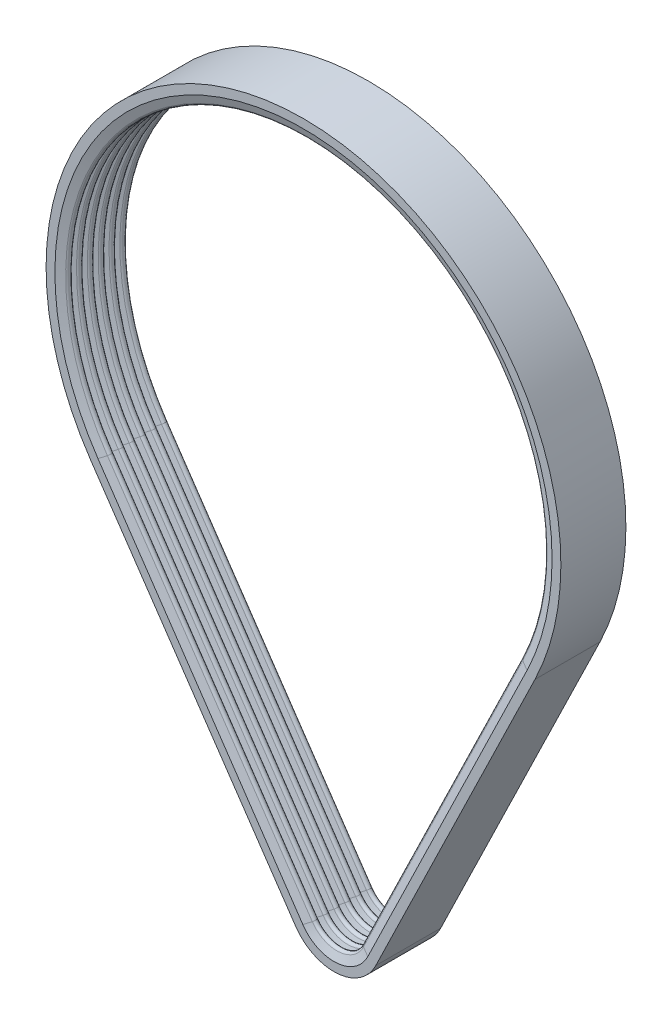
ISO-10303-21;
HEADER;
FILE_DESCRIPTION(('STEP AP214'),'2;1');
FILE_NAME('part.step','',(''),(''),'','','');
FILE_SCHEMA(('AUTOMOTIVE_DESIGN { 1 0 10303 214 1 1 1 1 }'));
ENDSEC;
DATA;
#1=APPLICATION_CONTEXT('core data for automotive mechanical design processes');
#2=APPLICATION_PROTOCOL_DEFINITION('international standard','automotive_design',2000,#1);
#3=PRODUCT_CONTEXT('',#1,'mechanical');
#4=PRODUCT('Part','Part','',(#3));
#5=PRODUCT_RELATED_PRODUCT_CATEGORY('part','',(#4));
#6=PRODUCT_DEFINITION_FORMATION('','',#4);
#7=PRODUCT_DEFINITION_CONTEXT('part definition',#1,'design');
#8=PRODUCT_DEFINITION('design','',#6,#7);
#9=PRODUCT_DEFINITION_SHAPE('','',#8);
#10=(LENGTH_UNIT() NAMED_UNIT(*) SI_UNIT(.MILLI.,.METRE.));
#11=(NAMED_UNIT(*) PLANE_ANGLE_UNIT() SI_UNIT($,.RADIAN.));
#12=(NAMED_UNIT(*) SI_UNIT($,.STERADIAN.) SOLID_ANGLE_UNIT());
#13=UNCERTAINTY_MEASURE_WITH_UNIT(LENGTH_MEASURE(1.E-05),#10,'distance_accuracy_value','');
#14=(GEOMETRIC_REPRESENTATION_CONTEXT(3) GLOBAL_UNCERTAINTY_ASSIGNED_CONTEXT((#13)) GLOBAL_UNIT_ASSIGNED_CONTEXT((#10,
#11,#12)) REPRESENTATION_CONTEXT('',''));
#15=CARTESIAN_POINT('',(0.,0.,0.));
#16=DIRECTION('',(0.,0.,1.));
#17=DIRECTION('',(1.,0.,0.));
#18=AXIS2_PLACEMENT_3D('',#15,#16,#17);
#19=CARTESIAN_POINT('',(84.0509956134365,-535.962702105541,0.8));
#20=DIRECTION('',(0.307580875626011,-0.149572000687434,-0.939692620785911));
#21=DIRECTION('',(-0.950383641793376,0.,-0.311080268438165));
#22=AXIS2_PLACEMENT_3D('',#19,#20,#21);
#23=PLANE('',#22);
#24=DIRECTION('',(-0.845071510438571,0.410945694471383,-0.342020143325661));
#25=VECTOR('',#24,1.);
#26=CARTESIAN_POINT('',(84.0509956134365,-535.962702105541,0.8));
#27=LINE('',#26,#25);
#28=CARTESIAN_POINT('',(85.7954731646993,-536.811015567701,1.5060307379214));
#29=VERTEX_POINT('',#28);
#30=CARTESIAN_POINT('',(84.9797215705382,-536.414327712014,1.17587704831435));
#31=VERTEX_POINT('',#30);
#32=EDGE_CURVE('E627',#29,#31,#27,.T.);
#33=ORIENTED_EDGE('',*,*,#32,.F.);
#34=DIRECTION('',(0.437319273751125,0.899306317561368,0.));
#35=VECTOR('',#34,1.);
#36=CARTESIAN_POINT('',(109.310506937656,-488.454540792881,1.5060307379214));
#37=LINE('',#36,#35);
#38=CARTESIAN_POINT('',(109.310506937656,-488.454540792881,1.5060307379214));
#39=VERTEX_POINT('',#38);
#40=EDGE_CURVE('E604',#29,#39,#37,.T.);
#41=ORIENTED_EDGE('',*,*,#40,.T.);
#42=DIRECTION('',(-0.845071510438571,0.410945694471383,-0.342020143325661));
#43=VECTOR('',#42,1.);
#44=CARTESIAN_POINT('',(107.566029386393,-487.60622733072,0.8));
#45=LINE('',#44,#43);
#46=CARTESIAN_POINT('',(108.494755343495,-488.057852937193,1.17587704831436));
#47=VERTEX_POINT('',#46);
#48=EDGE_CURVE('E878',#39,#47,#45,.T.);
#49=ORIENTED_EDGE('',*,*,#48,.T.);
#50=DIRECTION('',(0.437319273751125,0.899306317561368,0.));
#51=VECTOR('',#50,1.);
#52=CARTESIAN_POINT('',(84.9797215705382,-536.414327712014,1.17587704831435));
#53=LINE('',#52,#51);
#54=EDGE_CURVE('E462',#47,#31,#53,.F.);
#55=ORIENTED_EDGE('',*,*,#54,.T.);
#56=EDGE_LOOP('',(#33,#41,#49,#55));
#57=FACE_BOUND('',#56,.T.);
#58=ADVANCED_FACE('F31',(#57),#23,.F.);
#59=CARTESIAN_POINT('',(86.0276546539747,-536.92392196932,1.59999999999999));
#60=DIRECTION('',(0.307580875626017,-0.149572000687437,0.939692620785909));
#61=DIRECTION('',(0.950383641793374,0.,-0.311080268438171));
#62=AXIS2_PLACEMENT_3D('',#59,#60,#61);
#63=PLANE('',#62);
#64=DIRECTION('',(0.845071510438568,-0.410945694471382,-0.342020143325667));
#65=VECTOR('',#64,1.);
#66=CARTESIAN_POINT('',(109.542688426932,-488.567447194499,1.59999999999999));
#67=LINE('',#66,#65);
#68=CARTESIAN_POINT('',(108.494755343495,-488.057852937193,2.02412295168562));
#69=VERTEX_POINT('',#68);
#70=CARTESIAN_POINT('',(109.310506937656,-488.454540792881,1.69396926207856));
#71=VERTEX_POINT('',#70);
#72=EDGE_CURVE('E616',#69,#71,#67,.T.);
#73=ORIENTED_EDGE('',*,*,#72,.T.);
#74=DIRECTION('',(0.437319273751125,0.899306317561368,0.));
#75=VECTOR('',#74,1.);
#76=CARTESIAN_POINT('',(85.7954731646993,-536.811015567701,1.69396926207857));
#77=LINE('',#76,#75);
#78=CARTESIAN_POINT('',(85.7954731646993,-536.811015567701,1.69396926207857));
#79=VERTEX_POINT('',#78);
#80=EDGE_CURVE('E606',#71,#79,#77,.F.);
#81=ORIENTED_EDGE('',*,*,#80,.T.);
#82=DIRECTION('',(0.845071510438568,-0.410945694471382,-0.342020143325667));
#83=VECTOR('',#82,1.);
#84=CARTESIAN_POINT('',(86.0276546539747,-536.92392196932,1.59999999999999));
#85=LINE('',#84,#83);
#86=CARTESIAN_POINT('',(84.9797215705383,-536.414327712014,2.02412295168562));
#87=VERTEX_POINT('',#86);
#88=EDGE_CURVE('E613',#87,#79,#85,.T.);
#89=ORIENTED_EDGE('',*,*,#88,.F.);
#90=DIRECTION('',(0.437319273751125,0.899306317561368,0.));
#91=VECTOR('',#90,1.);
#92=CARTESIAN_POINT('',(84.9797215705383,-536.414327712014,2.02412295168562));
#93=LINE('',#92,#91);
#94=EDGE_CURVE('E476',#87,#69,#93,.T.);
#95=ORIENTED_EDGE('',*,*,#94,.T.);
#96=EDGE_LOOP('',(#73,#81,#89,#95));
#97=FACE_BOUND('',#96,.T.);
#98=ADVANCED_FACE('F612',(#97),#63,.F.);
#99=CARTESIAN_POINT('',(84.0509956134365,-535.962702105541,2.4));
#100=DIRECTION('',(0.307580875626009,-0.149572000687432,-0.939692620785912));
#101=DIRECTION('',(-0.950383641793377,0.,-0.311080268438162));
#102=AXIS2_PLACEMENT_3D('',#99,#100,#101);
#103=PLANE('',#102);
#104=DIRECTION('',(-0.845071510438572,0.410945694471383,-0.342020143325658));
#105=VECTOR('',#104,1.);
#106=CARTESIAN_POINT('',(84.0509956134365,-535.962702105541,2.4));
#107=LINE('',#106,#105);
#108=CARTESIAN_POINT('',(85.7954731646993,-536.811015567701,3.10603073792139));
#109=VERTEX_POINT('',#108);
#110=CARTESIAN_POINT('',(84.9797215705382,-536.414327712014,2.77587704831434));
#111=VERTEX_POINT('',#110);
#112=EDGE_CURVE('E628',#109,#111,#107,.T.);
#113=ORIENTED_EDGE('',*,*,#112,.F.);
#114=DIRECTION('',(0.437319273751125,0.899306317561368,0.));
#115=VECTOR('',#114,1.);
#116=CARTESIAN_POINT('',(109.310506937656,-488.454540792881,3.1060307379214));
#117=LINE('',#116,#115);
#118=CARTESIAN_POINT('',(109.310506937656,-488.454540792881,3.10603073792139));
#119=VERTEX_POINT('',#118);
#120=EDGE_CURVE('E38',#109,#119,#117,.T.);
#121=ORIENTED_EDGE('',*,*,#120,.T.);
#122=DIRECTION('',(-0.845071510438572,0.410945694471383,-0.342020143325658));
#123=VECTOR('',#122,1.);
#124=CARTESIAN_POINT('',(107.566029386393,-487.60622733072,2.4));
#125=LINE('',#124,#123);
#126=CARTESIAN_POINT('',(108.494755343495,-488.057852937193,2.77587704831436));
#127=VERTEX_POINT('',#126);
#128=EDGE_CURVE('E875',#119,#127,#125,.T.);
#129=ORIENTED_EDGE('',*,*,#128,.T.);
#130=DIRECTION('',(0.437319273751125,0.899306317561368,0.));
#131=VECTOR('',#130,1.);
#132=CARTESIAN_POINT('',(84.9797215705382,-536.414327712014,2.77587704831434));
#133=LINE('',#132,#131);
#134=EDGE_CURVE('E478',#127,#111,#133,.F.);
#135=ORIENTED_EDGE('',*,*,#134,.T.);
#136=EDGE_LOOP('',(#113,#121,#129,#135));
#137=FACE_BOUND('',#136,.T.);
#138=ADVANCED_FACE('F925',(#137),#103,.F.);
#139=CARTESIAN_POINT('',(86.0276546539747,-536.92392196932,3.19999999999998));
#140=DIRECTION('',(0.307580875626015,-0.149572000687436,0.93969262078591));
#141=DIRECTION('',(0.950383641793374,0.,-0.311080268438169));
#142=AXIS2_PLACEMENT_3D('',#139,#140,#141);
#143=PLANE('',#142);
#144=DIRECTION('',(0.845071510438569,-0.410945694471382,-0.342020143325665));
#145=VECTOR('',#144,1.);
#146=CARTESIAN_POINT('',(109.542688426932,-488.567447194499,3.19999999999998));
#147=LINE('',#146,#145);
#148=CARTESIAN_POINT('',(108.494755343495,-488.057852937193,3.6241229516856));
#149=VERTEX_POINT('',#148);
#150=CARTESIAN_POINT('',(109.310506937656,-488.454540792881,3.29396926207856));
#151=VERTEX_POINT('',#150);
#152=EDGE_CURVE('E873',#149,#151,#147,.T.);
#153=ORIENTED_EDGE('',*,*,#152,.T.);
#154=DIRECTION('',(0.437319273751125,0.899306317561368,0.));
#155=VECTOR('',#154,1.);
#156=CARTESIAN_POINT('',(85.7954731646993,-536.811015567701,3.29396926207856));
#157=LINE('',#156,#155);
#158=CARTESIAN_POINT('',(85.7954731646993,-536.811015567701,3.29396926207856));
#159=VERTEX_POINT('',#158);
#160=EDGE_CURVE('E11',#151,#159,#157,.F.);
#161=ORIENTED_EDGE('',*,*,#160,.T.);
#162=DIRECTION('',(0.845071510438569,-0.410945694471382,-0.342020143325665));
#163=VECTOR('',#162,1.);
#164=CARTESIAN_POINT('',(86.0276546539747,-536.92392196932,3.19999999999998));
#165=LINE('',#164,#163);
#166=CARTESIAN_POINT('',(84.9797215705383,-536.414327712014,3.62412295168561));
#167=VERTEX_POINT('',#166);
#168=EDGE_CURVE('E834',#167,#159,#165,.T.);
#169=ORIENTED_EDGE('',*,*,#168,.F.);
#170=DIRECTION('',(0.437319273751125,0.899306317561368,0.));
#171=VECTOR('',#170,1.);
#172=CARTESIAN_POINT('',(84.9797215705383,-536.414327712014,3.6241229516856));
#173=LINE('',#172,#171);
#174=EDGE_CURVE('E491',#167,#149,#173,.T.);
#175=ORIENTED_EDGE('',*,*,#174,.T.);
#176=EDGE_LOOP('',(#153,#161,#169,#175));
#177=FACE_BOUND('',#176,.T.);
#178=ADVANCED_FACE('F1115',(#177),#143,.F.);
#179=CARTESIAN_POINT('',(84.0509956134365,-535.962702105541,3.99999999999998));
#180=DIRECTION('',(0.307580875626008,-0.149572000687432,-0.939692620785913));
#181=DIRECTION('',(-0.950383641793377,0.,-0.311080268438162));
#182=AXIS2_PLACEMENT_3D('',#179,#180,#181);
#183=PLANE('',#182);
#184=DIRECTION('',(-0.845071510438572,0.410945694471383,-0.342020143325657));
#185=VECTOR('',#184,1.);
#186=CARTESIAN_POINT('',(107.566029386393,-487.60622733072,3.99999999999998));
#187=LINE('',#186,#185);
#188=CARTESIAN_POINT('',(109.542688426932,-488.567447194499,4.79999999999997));
#189=VERTEX_POINT('',#188);
#190=CARTESIAN_POINT('',(108.494755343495,-488.057852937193,4.37587704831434));
#191=VERTEX_POINT('',#190);
#192=EDGE_CURVE('E870',#189,#191,#187,.T.);
#193=ORIENTED_EDGE('',*,*,#192,.T.);
#194=DIRECTION('',(0.437319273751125,0.899306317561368,0.));
#195=VECTOR('',#194,1.);
#196=CARTESIAN_POINT('',(84.9797215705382,-536.414327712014,4.37587704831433));
#197=LINE('',#196,#195);
#198=CARTESIAN_POINT('',(84.9797215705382,-536.414327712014,4.37587704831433));
#199=VERTEX_POINT('',#198);
#200=EDGE_CURVE('E493',#191,#199,#197,.F.);
#201=ORIENTED_EDGE('',*,*,#200,.T.);
#202=DIRECTION('',(-0.845071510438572,0.410945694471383,-0.342020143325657));
#203=VECTOR('',#202,1.);
#204=CARTESIAN_POINT('',(84.0509956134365,-535.962702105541,3.99999999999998));
#205=LINE('',#204,#203);
#206=CARTESIAN_POINT('',(86.0276546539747,-536.92392196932,4.79999999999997));
#207=VERTEX_POINT('',#206);
#208=EDGE_CURVE('E831',#207,#199,#205,.T.);
#209=ORIENTED_EDGE('',*,*,#208,.F.);
#210=DIRECTION('',(0.437319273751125,0.899306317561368,0.));
#211=VECTOR('',#210,1.);
#212=CARTESIAN_POINT('',(86.0276546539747,-536.92392196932,4.79999999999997));
#213=LINE('',#212,#211);
#214=EDGE_CURVE('E404',#207,#189,#213,.T.);
#215=ORIENTED_EDGE('',*,*,#214,.T.);
#216=EDGE_LOOP('',(#193,#201,#209,#215));
#217=FACE_BOUND('',#216,.T.);
#218=ADVANCED_FACE('F1112',(#217),#183,.F.);
#219=CARTESIAN_POINT('',(87.1967528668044,-537.492437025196,-4.79999999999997));
#220=DIRECTION('',(-0.899306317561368,0.437319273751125,0.));
#221=DIRECTION('',(-0.437319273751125,-0.899306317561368,0.));
#222=AXIS2_PLACEMENT_3D('',#219,#220,#221);
#223=PLANE('',#222);
#224=DIRECTION('',(0.,0.,1.));
#225=VECTOR('',#224,1.);
#226=CARTESIAN_POINT('',(87.1967528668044,-537.492437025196,-4.79999999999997));
#227=LINE('',#226,#225);
#228=CARTESIAN_POINT('',(87.1967528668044,-537.492437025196,-4.79999999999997));
#229=VERTEX_POINT('',#228);
#230=CARTESIAN_POINT('',(87.1967528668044,-537.492437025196,4.79999999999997));
#231=VERTEX_POINT('',#230);
#232=EDGE_CURVE('E828',#229,#231,#227,.T.);
#233=ORIENTED_EDGE('',*,*,#232,.F.);
#234=DIRECTION('',(0.437319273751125,0.899306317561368,0.));
#235=VECTOR('',#234,1.);
#236=CARTESIAN_POINT('',(87.1967528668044,-537.492437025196,-4.79999999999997));
#237=LINE('',#236,#235);
#238=CARTESIAN_POINT('',(110.711786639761,-489.135962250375,-4.79999999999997));
#239=VERTEX_POINT('',#238);
#240=EDGE_CURVE('E881',#229,#239,#237,.T.);
#241=ORIENTED_EDGE('',*,*,#240,.T.);
#242=DIRECTION('',(0.,0.,1.));
#243=VECTOR('',#242,1.);
#244=CARTESIAN_POINT('',(110.711786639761,-489.135962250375,-4.79999999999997));
#245=LINE('',#244,#243);
#246=CARTESIAN_POINT('',(110.711786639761,-489.135962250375,4.79999999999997));
#247=VERTEX_POINT('',#246);
#248=EDGE_CURVE('E867',#239,#247,#245,.T.);
#249=ORIENTED_EDGE('',*,*,#248,.T.);
#250=DIRECTION('',(0.437319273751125,0.899306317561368,0.));
#251=VECTOR('',#250,1.);
#252=CARTESIAN_POINT('',(87.1967528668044,-537.492437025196,4.79999999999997));
#253=LINE('',#252,#251);
#254=EDGE_CURVE('E884',#231,#247,#253,.T.);
#255=ORIENTED_EDGE('',*,*,#254,.F.);
#256=EDGE_LOOP('',(#233,#241,#249,#255));
#257=FACE_BOUND('',#256,.T.);
#258=ADVANCED_FACE('F903',(#257),#223,.F.);
#259=CARTESIAN_POINT('',(84.0509956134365,-535.962702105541,-3.99999999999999));
#260=DIRECTION('',(0.307580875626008,-0.149572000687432,0.939692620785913));
#261=DIRECTION('',(0.950383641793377,0.,-0.311080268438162));
#262=AXIS2_PLACEMENT_3D('',#259,#260,#261);
#263=PLANE('',#262);
#264=DIRECTION('',(0.845071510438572,-0.410945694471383,-0.342020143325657));
#265=VECTOR('',#264,1.);
#266=CARTESIAN_POINT('',(84.0509956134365,-535.962702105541,-3.99999999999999));
#267=LINE('',#266,#265);
#268=CARTESIAN_POINT('',(84.9797215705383,-536.414327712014,-4.37587704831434));
#269=VERTEX_POINT('',#268);
#270=CARTESIAN_POINT('',(86.0276546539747,-536.92392196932,-4.79999999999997));
#271=VERTEX_POINT('',#270);
#272=EDGE_CURVE('E826',#269,#271,#267,.T.);
#273=ORIENTED_EDGE('',*,*,#272,.F.);
#274=DIRECTION('',(0.437319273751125,0.899306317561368,0.));
#275=VECTOR('',#274,1.);
#276=CARTESIAN_POINT('',(84.9797215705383,-536.414327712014,-4.37587704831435));
#277=LINE('',#276,#275);
#278=CARTESIAN_POINT('',(108.494755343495,-488.057852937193,-4.37587704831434));
#279=VERTEX_POINT('',#278);
#280=EDGE_CURVE('E412',#269,#279,#277,.T.);
#281=ORIENTED_EDGE('',*,*,#280,.T.);
#282=DIRECTION('',(0.845071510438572,-0.410945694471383,-0.342020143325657));
#283=VECTOR('',#282,1.);
#284=CARTESIAN_POINT('',(107.566029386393,-487.60622733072,-3.99999999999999));
#285=LINE('',#284,#283);
#286=CARTESIAN_POINT('',(109.542688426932,-488.567447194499,-4.79999999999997));
#287=VERTEX_POINT('',#286);
#288=EDGE_CURVE('E865',#279,#287,#285,.T.);
#289=ORIENTED_EDGE('',*,*,#288,.T.);
#290=DIRECTION('',(0.437319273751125,0.899306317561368,0.));
#291=VECTOR('',#290,1.);
#292=CARTESIAN_POINT('',(86.0276546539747,-536.92392196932,-4.79999999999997));
#293=LINE('',#292,#291);
#294=EDGE_CURVE('E388',#271,#287,#293,.T.);
#295=ORIENTED_EDGE('',*,*,#294,.F.);
#296=EDGE_LOOP('',(#273,#281,#289,#295));
#297=FACE_BOUND('',#296,.T.);
#298=ADVANCED_FACE('F1105',(#297),#263,.F.);
#299=CARTESIAN_POINT('',(86.0276546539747,-536.92392196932,-3.19999999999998));
#300=DIRECTION('',(0.307580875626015,-0.149572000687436,-0.93969262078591));
#301=DIRECTION('',(-0.950383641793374,0.,-0.311080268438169));
#302=AXIS2_PLACEMENT_3D('',#299,#300,#301);
#303=PLANE('',#302);
#304=DIRECTION('',(-0.845071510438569,0.410945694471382,-0.342020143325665));
#305=VECTOR('',#304,1.);
#306=CARTESIAN_POINT('',(86.0276546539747,-536.92392196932,-3.19999999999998));
#307=LINE('',#306,#305);
#308=CARTESIAN_POINT('',(85.7954731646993,-536.811015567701,-3.29396926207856));
#309=VERTEX_POINT('',#308);
#310=CARTESIAN_POINT('',(84.9797215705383,-536.414327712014,-3.6241229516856));
#311=VERTEX_POINT('',#310);
#312=EDGE_CURVE('E824',#309,#311,#307,.T.);
#313=ORIENTED_EDGE('',*,*,#312,.F.);
#314=DIRECTION('',(0.437319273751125,0.899306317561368,0.));
#315=VECTOR('',#314,1.);
#316=CARTESIAN_POINT('',(109.310506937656,-488.454540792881,-3.29396926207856));
#317=LINE('',#316,#315);
#318=CARTESIAN_POINT('',(109.310506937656,-488.454540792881,-3.29396926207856));
#319=VERTEX_POINT('',#318);
#320=EDGE_CURVE('E592',#309,#319,#317,.T.);
#321=ORIENTED_EDGE('',*,*,#320,.T.);
#322=DIRECTION('',(-0.845071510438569,0.410945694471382,-0.342020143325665));
#323=VECTOR('',#322,1.);
#324=CARTESIAN_POINT('',(109.542688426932,-488.567447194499,-3.19999999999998));
#325=LINE('',#324,#323);
#326=CARTESIAN_POINT('',(108.494755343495,-488.057852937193,-3.62412295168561));
#327=VERTEX_POINT('',#326);
#328=EDGE_CURVE('E863',#319,#327,#325,.T.);
#329=ORIENTED_EDGE('',*,*,#328,.T.);
#330=DIRECTION('',(0.437319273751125,0.899306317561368,0.));
#331=VECTOR('',#330,1.);
#332=CARTESIAN_POINT('',(84.9797215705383,-536.414327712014,-3.62412295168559));
#333=LINE('',#332,#331);
#334=EDGE_CURVE('E414',#327,#311,#333,.F.);
#335=ORIENTED_EDGE('',*,*,#334,.T.);
#336=EDGE_LOOP('',(#313,#321,#329,#335));
#337=FACE_BOUND('',#336,.T.);
#338=ADVANCED_FACE('F1101',(#337),#303,.F.);
#339=CARTESIAN_POINT('',(84.0509956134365,-535.962702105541,-2.4));
#340=DIRECTION('',(0.307580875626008,-0.149572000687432,0.939692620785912));
#341=DIRECTION('',(0.950383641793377,0.,-0.311080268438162));
#342=AXIS2_PLACEMENT_3D('',#339,#340,#341);
#343=PLANE('',#342);
#344=DIRECTION('',(0.845071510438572,-0.410945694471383,-0.342020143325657));
#345=VECTOR('',#344,1.);
#346=CARTESIAN_POINT('',(107.566029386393,-487.60622733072,-2.4));
#347=LINE('',#346,#345);
#348=CARTESIAN_POINT('',(108.494755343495,-488.057852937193,-2.77587704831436));
#349=VERTEX_POINT('',#348);
#350=CARTESIAN_POINT('',(109.310506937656,-488.454540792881,-3.10603073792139));
#351=VERTEX_POINT('',#350);
#352=EDGE_CURVE('E860',#349,#351,#347,.T.);
#353=ORIENTED_EDGE('',*,*,#352,.T.);
#354=DIRECTION('',(0.437319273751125,0.899306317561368,0.));
#355=VECTOR('',#354,1.);
#356=CARTESIAN_POINT('',(85.7954731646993,-536.811015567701,-3.10603073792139));
#357=LINE('',#356,#355);
#358=CARTESIAN_POINT('',(85.7954731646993,-536.811015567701,-3.10603073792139));
#359=VERTEX_POINT('',#358);
#360=EDGE_CURVE('E594',#351,#359,#357,.F.);
#361=ORIENTED_EDGE('',*,*,#360,.T.);
#362=DIRECTION('',(0.845071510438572,-0.410945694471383,-0.342020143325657));
#363=VECTOR('',#362,1.);
#364=CARTESIAN_POINT('',(84.0509956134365,-535.962702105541,-2.4));
#365=LINE('',#364,#363);
#366=CARTESIAN_POINT('',(84.9797215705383,-536.414327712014,-2.77587704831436));
#367=VERTEX_POINT('',#366);
#368=EDGE_CURVE('E821',#367,#359,#365,.T.);
#369=ORIENTED_EDGE('',*,*,#368,.F.);
#370=DIRECTION('',(0.437319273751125,0.899306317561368,0.));
#371=VECTOR('',#370,1.);
#372=CARTESIAN_POINT('',(84.9797215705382,-536.414327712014,-2.77587704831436));
#373=LINE('',#372,#371);
#374=EDGE_CURVE('E428',#367,#349,#373,.T.);
#375=ORIENTED_EDGE('',*,*,#374,.T.);
#376=EDGE_LOOP('',(#353,#361,#369,#375));
#377=FACE_BOUND('',#376,.T.);
#378=ADVANCED_FACE('F1095',(#377),#343,.F.);
#379=CARTESIAN_POINT('',(86.0276546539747,-536.92392196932,-1.59999999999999));
#380=DIRECTION('',(0.307580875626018,-0.149572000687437,-0.939692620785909));
#381=DIRECTION('',(-0.950383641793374,0.,-0.311080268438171));
#382=AXIS2_PLACEMENT_3D('',#379,#380,#381);
#383=PLANE('',#382);
#384=DIRECTION('',(-0.845071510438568,0.410945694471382,-0.342020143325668));
#385=VECTOR('',#384,1.);
#386=CARTESIAN_POINT('',(86.0276546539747,-536.92392196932,-1.59999999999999));
#387=LINE('',#386,#385);
#388=CARTESIAN_POINT('',(85.7954731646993,-536.811015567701,-1.69396926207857));
#389=VERTEX_POINT('',#388);
#390=CARTESIAN_POINT('',(84.9797215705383,-536.414327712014,-2.02412295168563));
#391=VERTEX_POINT('',#390);
#392=EDGE_CURVE('E819',#389,#391,#387,.T.);
#393=ORIENTED_EDGE('',*,*,#392,.F.);
#394=DIRECTION('',(0.437319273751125,0.899306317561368,0.));
#395=VECTOR('',#394,1.);
#396=CARTESIAN_POINT('',(109.310506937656,-488.454540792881,-1.69396926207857));
#397=LINE('',#396,#395);
#398=CARTESIAN_POINT('',(109.310506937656,-488.454540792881,-1.69396926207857));
#399=VERTEX_POINT('',#398);
#400=EDGE_CURVE('E596',#389,#399,#397,.T.);
#401=ORIENTED_EDGE('',*,*,#400,.T.);
#402=DIRECTION('',(-0.845071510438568,0.410945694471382,-0.342020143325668));
#403=VECTOR('',#402,1.);
#404=CARTESIAN_POINT('',(109.542688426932,-488.567447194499,-1.59999999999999));
#405=LINE('',#404,#403);
#406=CARTESIAN_POINT('',(108.494755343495,-488.057852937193,-2.02412295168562));
#407=VERTEX_POINT('',#406);
#408=EDGE_CURVE('E858',#399,#407,#405,.T.);
#409=ORIENTED_EDGE('',*,*,#408,.T.);
#410=DIRECTION('',(0.437319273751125,0.899306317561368,0.));
#411=VECTOR('',#410,1.);
#412=CARTESIAN_POINT('',(84.9797215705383,-536.414327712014,-2.02412295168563));
#413=LINE('',#412,#411);
#414=EDGE_CURVE('E430',#407,#391,#413,.F.);
#415=ORIENTED_EDGE('',*,*,#414,.T.);
#416=EDGE_LOOP('',(#393,#401,#409,#415));
#417=FACE_BOUND('',#416,.T.);
#418=ADVANCED_FACE('F1060',(#417),#383,.F.);
#419=CARTESIAN_POINT('',(84.0509956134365,-535.962702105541,-0.800000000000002));
#420=DIRECTION('',(0.307580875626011,-0.149572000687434,0.939692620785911));
#421=DIRECTION('',(0.950383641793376,0.,-0.311080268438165));
#422=AXIS2_PLACEMENT_3D('',#419,#420,#421);
#423=PLANE('',#422);
#424=DIRECTION('',(0.845071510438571,-0.410945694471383,-0.342020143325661));
#425=VECTOR('',#424,1.);
#426=CARTESIAN_POINT('',(107.566029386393,-487.60622733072,-0.800000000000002));
#427=LINE('',#426,#425);
#428=CARTESIAN_POINT('',(108.494755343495,-488.057852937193,-1.17587704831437));
#429=VERTEX_POINT('',#428);
#430=CARTESIAN_POINT('',(109.310506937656,-488.454540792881,-1.5060307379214));
#431=VERTEX_POINT('',#430);
#432=EDGE_CURVE('E855',#429,#431,#427,.T.);
#433=ORIENTED_EDGE('',*,*,#432,.T.);
#434=DIRECTION('',(0.437319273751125,0.899306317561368,0.));
#435=VECTOR('',#434,1.);
#436=CARTESIAN_POINT('',(85.7954731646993,-536.811015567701,-1.5060307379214));
#437=LINE('',#436,#435);
#438=CARTESIAN_POINT('',(85.7954731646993,-536.811015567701,-1.5060307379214));
#439=VERTEX_POINT('',#438);
#440=EDGE_CURVE('E598',#431,#439,#437,.F.);
#441=ORIENTED_EDGE('',*,*,#440,.T.);
#442=DIRECTION('',(0.845071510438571,-0.410945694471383,-0.342020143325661));
#443=VECTOR('',#442,1.);
#444=CARTESIAN_POINT('',(84.0509956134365,-535.962702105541,-0.800000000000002));
#445=LINE('',#444,#443);
#446=CARTESIAN_POINT('',(84.9797215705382,-536.414327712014,-1.17587704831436));
#447=VERTEX_POINT('',#446);
#448=EDGE_CURVE('E816',#447,#439,#445,.T.);
#449=ORIENTED_EDGE('',*,*,#448,.F.);
#450=DIRECTION('',(0.437319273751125,0.899306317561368,0.));
#451=VECTOR('',#450,1.);
#452=CARTESIAN_POINT('',(84.9797215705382,-536.414327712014,-1.17587704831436));
#453=LINE('',#452,#451);
#454=EDGE_CURVE('E444',#447,#429,#453,.T.);
#455=ORIENTED_EDGE('',*,*,#454,.T.);
#456=EDGE_LOOP('',(#433,#441,#449,#455));
#457=FACE_BOUND('',#456,.T.);
#458=ADVANCED_FACE('F1086',(#457),#423,.F.);
#459=CARTESIAN_POINT('',(86.0276546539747,-536.92392196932,0.));
#460=DIRECTION('',(0.307580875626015,-0.149572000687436,-0.93969262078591));
#461=DIRECTION('',(-0.950383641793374,0.,-0.311080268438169));
#462=AXIS2_PLACEMENT_3D('',#459,#460,#461);
#463=PLANE('',#462);
#464=DIRECTION('',(-0.845071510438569,0.410945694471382,-0.342020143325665));
#465=VECTOR('',#464,1.);
#466=CARTESIAN_POINT('',(86.0276546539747,-536.92392196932,0.));
#467=LINE('',#466,#465);
#468=CARTESIAN_POINT('',(85.7954731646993,-536.811015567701,-0.0939692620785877));
#469=VERTEX_POINT('',#468);
#470=CARTESIAN_POINT('',(84.9797215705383,-536.414327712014,-0.42412295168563));
#471=VERTEX_POINT('',#470);
#472=EDGE_CURVE('E814',#469,#471,#467,.T.);
#473=ORIENTED_EDGE('',*,*,#472,.F.);
#474=DIRECTION('',(0.437319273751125,0.899306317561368,0.));
#475=VECTOR('',#474,1.);
#476=CARTESIAN_POINT('',(109.310506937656,-488.454540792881,-0.0939692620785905));
#477=LINE('',#476,#475);
#478=CARTESIAN_POINT('',(109.310506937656,-488.454540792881,-0.0939692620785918));
#479=VERTEX_POINT('',#478);
#480=EDGE_CURVE('E600',#469,#479,#477,.T.);
#481=ORIENTED_EDGE('',*,*,#480,.T.);
#482=DIRECTION('',(-0.845071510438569,0.410945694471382,-0.342020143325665));
#483=VECTOR('',#482,1.);
#484=CARTESIAN_POINT('',(109.542688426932,-488.567447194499,0.));
#485=LINE('',#484,#483);
#486=CARTESIAN_POINT('',(108.494755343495,-488.057852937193,-0.424122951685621));
#487=VERTEX_POINT('',#486);
#488=EDGE_CURVE('E853',#479,#487,#485,.T.);
#489=ORIENTED_EDGE('',*,*,#488,.T.);
#490=DIRECTION('',(0.437319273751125,0.899306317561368,0.));
#491=VECTOR('',#490,1.);
#492=CARTESIAN_POINT('',(84.9797215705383,-536.414327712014,-0.42412295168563));
#493=LINE('',#492,#491);
#494=EDGE_CURVE('E446',#487,#471,#493,.F.);
#495=ORIENTED_EDGE('',*,*,#494,.T.);
#496=EDGE_LOOP('',(#473,#481,#489,#495));
#497=FACE_BOUND('',#496,.T.);
#498=ADVANCED_FACE('F989',(#497),#463,.F.);
#499=CARTESIAN_POINT('',(86.0276546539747,-536.92392196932,0.));
#500=DIRECTION('',(0.307580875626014,-0.149572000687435,0.93969262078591));
#501=DIRECTION('',(0.950383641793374,0.,-0.311080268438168));
#502=AXIS2_PLACEMENT_3D('',#499,#500,#501);
#503=PLANE('',#502);
#504=DIRECTION('',(0.84507151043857,-0.410945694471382,-0.342020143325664));
#505=VECTOR('',#504,1.);
#506=CARTESIAN_POINT('',(109.542688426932,-488.567447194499,0.));
#507=LINE('',#506,#505);
#508=CARTESIAN_POINT('',(108.494755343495,-488.057852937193,0.42412295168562));
#509=VERTEX_POINT('',#508);
#510=CARTESIAN_POINT('',(109.310506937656,-488.454540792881,0.0939692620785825));
#511=VERTEX_POINT('',#510);
#512=EDGE_CURVE('E850',#509,#511,#507,.T.);
#513=ORIENTED_EDGE('',*,*,#512,.T.);
#514=DIRECTION('',(0.437319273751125,0.899306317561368,0.));
#515=VECTOR('',#514,1.);
#516=CARTESIAN_POINT('',(85.7954731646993,-536.811015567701,0.0939692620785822));
#517=LINE('',#516,#515);
#518=CARTESIAN_POINT('',(85.7954731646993,-536.811015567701,0.0939692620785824));
#519=VERTEX_POINT('',#518);
#520=EDGE_CURVE('E602',#511,#519,#517,.F.);
#521=ORIENTED_EDGE('',*,*,#520,.T.);
#522=DIRECTION('',(0.84507151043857,-0.410945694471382,-0.342020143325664));
#523=VECTOR('',#522,1.);
#524=CARTESIAN_POINT('',(86.0276546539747,-536.92392196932,0.));
#525=LINE('',#524,#523);
#526=CARTESIAN_POINT('',(84.9797215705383,-536.414327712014,0.424122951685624));
#527=VERTEX_POINT('',#526);
#528=EDGE_CURVE('E811',#527,#519,#525,.T.);
#529=ORIENTED_EDGE('',*,*,#528,.F.);
#530=DIRECTION('',(0.437319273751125,0.899306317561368,0.));
#531=VECTOR('',#530,1.);
#532=CARTESIAN_POINT('',(84.9797215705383,-536.414327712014,0.42412295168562));
#533=LINE('',#532,#531);
#534=EDGE_CURVE('E460',#527,#509,#533,.T.);
#535=ORIENTED_EDGE('',*,*,#534,.T.);
#536=EDGE_LOOP('',(#513,#521,#529,#535));
#537=FACE_BOUND('',#536,.T.);
#538=ADVANCED_FACE('F1093',(#537),#503,.F.);
#539=CARTESIAN_POINT('',(81.0365045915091,-534.496800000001,1.59999999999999));
#540=DIRECTION('',(0.,0.,1.));
#541=DIRECTION('',(1.,0.,0.));
#542=AXIS2_PLACEMENT_3D('',#539,#540,#541);
#543=CONICAL_SURFACE('',#542,5.54999999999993,1.22173047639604);
#544=DIRECTION('',(0.776875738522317,0.52866464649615,-0.342020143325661));
#545=VECTOR('',#544,1.);
#546=CARTESIAN_POINT('',(78.265277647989,-536.38262245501,0.8));
#547=LINE('',#546,#545);
#548=CARTESIAN_POINT('',(76.661576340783,-537.473942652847,1.50603073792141));
#549=VERTEX_POINT('',#548);
#550=CARTESIAN_POINT('',(77.4114982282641,-536.963620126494,1.17587704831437));
#551=VERTEX_POINT('',#550);
#552=EDGE_CURVE('E384',#549,#551,#547,.T.);
#553=ORIENTED_EDGE('',*,*,#552,.F.);
#554=CARTESIAN_POINT('',(81.0365045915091,-534.496800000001,1.50603073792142));
#555=DIRECTION('',(0.,0.,1.));
#556=DIRECTION('',(1.,0.,0.));
#557=AXIS2_PLACEMENT_3D('',#554,#555,#556);
#558=CIRCLE('',#557,5.29182157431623);
#559=EDGE_CURVE('E565',#549,#29,#558,.T.);
#560=ORIENTED_EDGE('',*,*,#559,.T.);
#561=ORIENTED_EDGE('',*,*,#32,.T.);
#562=CARTESIAN_POINT('',(81.0365045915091,-534.496800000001,1.17587704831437));
#563=DIRECTION('',(0.,0.,-1.));
#564=DIRECTION('',(-1.,0.,0.));
#565=AXIS2_PLACEMENT_3D('',#562,#563,#564);
#566=CIRCLE('',#565,4.38473176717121);
#567=EDGE_CURVE('E457',#31,#551,#566,.T.);
#568=ORIENTED_EDGE('',*,*,#567,.T.);
#569=EDGE_LOOP('',(#553,#560,#561,#568));
#570=FACE_BOUND('',#569,.T.);
#571=ADVANCED_FACE('F932',(#570),#543,.F.);
#572=CARTESIAN_POINT('',(81.0365045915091,-534.496800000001,2.4));
#573=DIRECTION('',(0.,0.,-1.));
#574=DIRECTION('',(-1.,0.,0.));
#575=AXIS2_PLACEMENT_3D('',#572,#573,#574);
#576=CONICAL_SURFACE('',#575,3.3520180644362,1.22173047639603);
#577=ORIENTED_EDGE('',*,*,#88,.T.);
#578=CARTESIAN_POINT('',(81.0365045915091,-534.496800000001,1.69396926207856));
#579=DIRECTION('',(0.,0.,-1.));
#580=DIRECTION('',(-1.,0.,0.));
#581=AXIS2_PLACEMENT_3D('',#578,#579,#580);
#582=CIRCLE('',#581,5.29182157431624);
#583=CARTESIAN_POINT('',(76.661576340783,-537.473942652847,1.69396926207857));
#584=VERTEX_POINT('',#583);
#585=EDGE_CURVE('E568',#79,#584,#582,.T.);
#586=ORIENTED_EDGE('',*,*,#585,.T.);
#587=DIRECTION('',(-0.776875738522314,-0.528664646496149,-0.342020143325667));
#588=VECTOR('',#587,1.);
#589=CARTESIAN_POINT('',(76.4481314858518,-537.619192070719,1.59999999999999));
#590=LINE('',#589,#588);
#591=CARTESIAN_POINT('',(77.4114982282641,-536.963620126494,2.02412295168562));
#592=VERTEX_POINT('',#591);
#593=EDGE_CURVE('E800',#592,#584,#590,.T.);
#594=ORIENTED_EDGE('',*,*,#593,.F.);
#595=CARTESIAN_POINT('',(81.0365045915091,-534.496800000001,2.02412295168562));
#596=DIRECTION('',(0.,0.,1.));
#597=DIRECTION('',(1.,0.,0.));
#598=AXIS2_PLACEMENT_3D('',#595,#596,#597);
#599=CIRCLE('',#598,4.38473176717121);
#600=EDGE_CURVE('E471',#592,#87,#599,.T.);
#601=ORIENTED_EDGE('',*,*,#600,.T.);
#602=EDGE_LOOP('',(#577,#586,#594,#601));
#603=FACE_BOUND('',#602,.T.);
#604=ADVANCED_FACE('F623',(#603),#576,.F.);
#605=CARTESIAN_POINT('',(81.0365045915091,-534.496800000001,3.19999999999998));
#606=DIRECTION('',(0.,0.,1.));
#607=DIRECTION('',(1.,0.,0.));
#608=AXIS2_PLACEMENT_3D('',#605,#606,#607);
#609=CONICAL_SURFACE('',#608,5.54999999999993,1.22173047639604);
#610=DIRECTION('',(0.776875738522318,0.528664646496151,-0.342020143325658));
#611=VECTOR('',#610,1.);
#612=CARTESIAN_POINT('',(78.265277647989,-536.38262245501,2.4));
#613=LINE('',#612,#611);
#614=CARTESIAN_POINT('',(76.661576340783,-537.473942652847,3.1060307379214));
#615=VERTEX_POINT('',#614);
#616=CARTESIAN_POINT('',(77.4114982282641,-536.963620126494,2.77587704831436));
#617=VERTEX_POINT('',#616);
#618=EDGE_CURVE('E798',#615,#617,#613,.T.);
#619=ORIENTED_EDGE('',*,*,#618,.F.);
#620=CARTESIAN_POINT('',(81.0365045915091,-534.496800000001,3.10603073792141));
#621=DIRECTION('',(0.,0.,1.));
#622=DIRECTION('',(1.,0.,0.));
#623=AXIS2_PLACEMENT_3D('',#620,#621,#622);
#624=CIRCLE('',#623,5.29182157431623);
#625=EDGE_CURVE('E579',#615,#109,#624,.T.);
#626=ORIENTED_EDGE('',*,*,#625,.T.);
#627=ORIENTED_EDGE('',*,*,#112,.T.);
#628=CARTESIAN_POINT('',(81.0365045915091,-534.496800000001,2.77587704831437));
#629=DIRECTION('',(0.,0.,-1.));
#630=DIRECTION('',(-1.,0.,0.));
#631=AXIS2_PLACEMENT_3D('',#628,#629,#630);
#632=CIRCLE('',#631,4.38473176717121);
#633=EDGE_CURVE('E473',#111,#617,#632,.T.);
#634=ORIENTED_EDGE('',*,*,#633,.T.);
#635=EDGE_LOOP('',(#619,#626,#627,#634));
#636=FACE_BOUND('',#635,.T.);
#637=ADVANCED_FACE('F1127',(#636),#609,.F.);
#638=CARTESIAN_POINT('',(81.0365045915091,-534.496800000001,3.99999999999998));
#639=DIRECTION('',(0.,0.,-1.));
#640=DIRECTION('',(-1.,0.,0.));
#641=AXIS2_PLACEMENT_3D('',#638,#639,#640);
#642=CONICAL_SURFACE('',#641,3.3520180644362,1.22173047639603);
#643=ORIENTED_EDGE('',*,*,#168,.T.);
#644=CARTESIAN_POINT('',(81.0365045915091,-534.496800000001,3.29396926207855));
#645=DIRECTION('',(0.,0.,-1.));
#646=DIRECTION('',(-1.,0.,0.));
#647=AXIS2_PLACEMENT_3D('',#644,#645,#646);
#648=CIRCLE('',#647,5.29182157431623);
#649=CARTESIAN_POINT('',(76.661576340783,-537.473942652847,3.29396926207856));
#650=VERTEX_POINT('',#649);
#651=EDGE_CURVE('E582',#159,#650,#648,.T.);
#652=ORIENTED_EDGE('',*,*,#651,.T.);
#653=DIRECTION('',(-0.776875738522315,-0.52866464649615,-0.342020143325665));
#654=VECTOR('',#653,1.);
#655=CARTESIAN_POINT('',(76.4481314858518,-537.619192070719,3.19999999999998));
#656=LINE('',#655,#654);
#657=CARTESIAN_POINT('',(77.4114982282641,-536.963620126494,3.62412295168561));
#658=VERTEX_POINT('',#657);
#659=EDGE_CURVE('E795',#658,#650,#656,.T.);
#660=ORIENTED_EDGE('',*,*,#659,.F.);
#661=CARTESIAN_POINT('',(81.0365045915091,-534.496800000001,3.62412295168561));
#662=DIRECTION('',(0.,0.,1.));
#663=DIRECTION('',(1.,0.,0.));
#664=AXIS2_PLACEMENT_3D('',#661,#662,#663);
#665=CIRCLE('',#664,4.38473176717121);
#666=EDGE_CURVE('E487',#658,#167,#665,.T.);
#667=ORIENTED_EDGE('',*,*,#666,.T.);
#668=EDGE_LOOP('',(#643,#652,#660,#667));
#669=FACE_BOUND('',#668,.T.);
#670=ADVANCED_FACE('F1327',(#669),#642,.F.);
#671=CARTESIAN_POINT('',(81.0365045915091,-534.496800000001,4.79999999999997));
#672=DIRECTION('',(0.,0.,1.));
#673=DIRECTION('',(1.,0.,0.));
#674=AXIS2_PLACEMENT_3D('',#671,#672,#673);
#675=CONICAL_SURFACE('',#674,5.54999999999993,1.22173047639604);
#676=ORIENTED_EDGE('',*,*,#208,.T.);
#677=CARTESIAN_POINT('',(81.0365045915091,-534.496800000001,4.37587704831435));
#678=DIRECTION('',(0.,0.,-1.));
#679=DIRECTION('',(-1.,0.,0.));
#680=AXIS2_PLACEMENT_3D('',#677,#678,#679);
#681=CIRCLE('',#680,4.38473176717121);
#682=CARTESIAN_POINT('',(77.411498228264,-536.963620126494,4.37587704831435));
#683=VERTEX_POINT('',#682);
#684=EDGE_CURVE('E489',#199,#683,#681,.T.);
#685=ORIENTED_EDGE('',*,*,#684,.T.);
#686=DIRECTION('',(0.776875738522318,0.528664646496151,-0.342020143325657));
#687=VECTOR('',#686,1.);
#688=CARTESIAN_POINT('',(78.265277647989,-536.38262245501,3.99999999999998));
#689=LINE('',#688,#687);
#690=CARTESIAN_POINT('',(76.4481314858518,-537.619192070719,4.79999999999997));
#691=VERTEX_POINT('',#690);
#692=EDGE_CURVE('E792',#691,#683,#689,.T.);
#693=ORIENTED_EDGE('',*,*,#692,.F.);
#694=CARTESIAN_POINT('',(81.0365045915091,-534.496800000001,4.79999999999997));
#695=DIRECTION('',(0.,0.,1.));
#696=DIRECTION('',(1.,0.,0.));
#697=AXIS2_PLACEMENT_3D('',#694,#695,#696);
#698=CIRCLE('',#697,5.54999999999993);
#699=EDGE_CURVE('E847',#691,#207,#698,.T.);
#700=ORIENTED_EDGE('',*,*,#699,.T.);
#701=EDGE_LOOP('',(#676,#685,#693,#700));
#702=FACE_BOUND('',#701,.T.);
#703=ADVANCED_FACE('F1324',(#702),#675,.F.);
#704=CARTESIAN_POINT('',(81.0365045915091,-534.496800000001,0.));
#705=DIRECTION('',(0.,0.,1.));
#706=DIRECTION('',(1.,0.,0.));
#707=AXIS2_PLACEMENT_3D('',#704,#705,#706);
#708=CYLINDRICAL_SURFACE('',#707,6.84999999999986);
#709=DIRECTION('',(0.,0.,1.));
#710=VECTOR('',#709,1.);
#711=CARTESIAN_POINT('',(75.3733774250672,-538.350563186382,-4.79999999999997));
#712=LINE('',#711,#710);
#713=CARTESIAN_POINT('',(75.3733774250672,-538.350563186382,-4.79999999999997));
#714=VERTEX_POINT('',#713);
#715=CARTESIAN_POINT('',(75.3733774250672,-538.350563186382,4.79999999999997));
#716=VERTEX_POINT('',#715);
#717=EDGE_CURVE('E789',#714,#716,#712,.T.);
#718=ORIENTED_EDGE('',*,*,#717,.F.);
#719=CARTESIAN_POINT('',(81.0365045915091,-534.496800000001,-4.79999999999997));
#720=DIRECTION('',(0.,0.,1.));
#721=DIRECTION('',(1.,0.,0.));
#722=AXIS2_PLACEMENT_3D('',#719,#720,#721);
#723=CIRCLE('',#722,6.84999999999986);
#724=EDGE_CURVE('E841',#714,#229,#723,.T.);
#725=ORIENTED_EDGE('',*,*,#724,.T.);
#726=ORIENTED_EDGE('',*,*,#232,.T.);
#727=CARTESIAN_POINT('',(81.0365045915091,-534.496800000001,4.79999999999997));
#728=DIRECTION('',(0.,0.,1.));
#729=DIRECTION('',(1.,0.,0.));
#730=AXIS2_PLACEMENT_3D('',#727,#728,#729);
#731=CIRCLE('',#730,6.84999999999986);
#732=EDGE_CURVE('E844',#716,#231,#731,.T.);
#733=ORIENTED_EDGE('',*,*,#732,.F.);
#734=EDGE_LOOP('',(#718,#725,#726,#733));
#735=FACE_BOUND('',#734,.T.);
#736=ADVANCED_FACE('F907',(#735),#708,.T.);
#737=CARTESIAN_POINT('',(81.0365045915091,-534.496800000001,-3.99999999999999));
#738=DIRECTION('',(0.,0.,-1.));
#739=DIRECTION('',(-1.,0.,0.));
#740=AXIS2_PLACEMENT_3D('',#737,#738,#739);
#741=CONICAL_SURFACE('',#740,3.3520180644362,1.22173047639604);
#742=DIRECTION('',(-0.776875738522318,-0.528664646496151,-0.342020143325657));
#743=VECTOR('',#742,1.);
#744=CARTESIAN_POINT('',(78.265277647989,-536.38262245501,-3.99999999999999));
#745=LINE('',#744,#743);
#746=CARTESIAN_POINT('',(77.411498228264,-536.963620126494,-4.37587704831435));
#747=VERTEX_POINT('',#746);
#748=CARTESIAN_POINT('',(76.4481314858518,-537.619192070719,-4.79999999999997));
#749=VERTEX_POINT('',#748);
#750=EDGE_CURVE('E379',#747,#749,#745,.T.);
#751=ORIENTED_EDGE('',*,*,#750,.F.);
#752=CARTESIAN_POINT('',(81.0365045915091,-534.496800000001,-4.37587704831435));
#753=DIRECTION('',(0.,0.,1.));
#754=DIRECTION('',(1.,0.,0.));
#755=AXIS2_PLACEMENT_3D('',#752,#753,#754);
#756=CIRCLE('',#755,4.38473176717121);
#757=EDGE_CURVE('E407',#747,#269,#756,.T.);
#758=ORIENTED_EDGE('',*,*,#757,.T.);
#759=ORIENTED_EDGE('',*,*,#272,.T.);
#760=CARTESIAN_POINT('',(81.0365045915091,-534.496800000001,-4.79999999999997));
#761=DIRECTION('',(0.,0.,1.));
#762=DIRECTION('',(1.,0.,0.));
#763=AXIS2_PLACEMENT_3D('',#760,#761,#762);
#764=CIRCLE('',#763,5.54999999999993);
#765=EDGE_CURVE('E839',#749,#271,#764,.T.);
#766=ORIENTED_EDGE('',*,*,#765,.F.);
#767=EDGE_LOOP('',(#751,#758,#759,#766));
#768=FACE_BOUND('',#767,.T.);
#769=ADVANCED_FACE('F1317',(#768),#741,.F.);
#770=CARTESIAN_POINT('',(81.0365045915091,-534.496800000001,-3.19999999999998));
#771=DIRECTION('',(0.,0.,1.));
#772=DIRECTION('',(1.,0.,0.));
#773=AXIS2_PLACEMENT_3D('',#770,#771,#772);
#774=CONICAL_SURFACE('',#773,5.54999999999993,1.22173047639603);
#775=DIRECTION('',(0.776875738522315,0.52866464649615,-0.342020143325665));
#776=VECTOR('',#775,1.);
#777=CARTESIAN_POINT('',(76.4481314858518,-537.619192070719,-3.19999999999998));
#778=LINE('',#777,#776);
#779=CARTESIAN_POINT('',(76.661576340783,-537.473942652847,-3.29396926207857));
#780=VERTEX_POINT('',#779);
#781=CARTESIAN_POINT('',(77.4114982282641,-536.963620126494,-3.62412295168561));
#782=VERTEX_POINT('',#781);
#783=EDGE_CURVE('E786',#780,#782,#778,.T.);
#784=ORIENTED_EDGE('',*,*,#783,.F.);
#785=CARTESIAN_POINT('',(81.0365045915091,-534.496800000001,-3.29396926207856));
#786=DIRECTION('',(0.,0.,1.));
#787=DIRECTION('',(1.,0.,0.));
#788=AXIS2_PLACEMENT_3D('',#785,#786,#787);
#789=CIRCLE('',#788,5.29182157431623);
#790=EDGE_CURVE('E523',#780,#309,#789,.T.);
#791=ORIENTED_EDGE('',*,*,#790,.T.);
#792=ORIENTED_EDGE('',*,*,#312,.T.);
#793=CARTESIAN_POINT('',(81.0365045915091,-534.496800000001,-3.62412295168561));
#794=DIRECTION('',(0.,0.,-1.));
#795=DIRECTION('',(-1.,0.,0.));
#796=AXIS2_PLACEMENT_3D('',#793,#794,#795);
#797=CIRCLE('',#796,4.38473176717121);
#798=EDGE_CURVE('E409',#311,#782,#797,.T.);
#799=ORIENTED_EDGE('',*,*,#798,.T.);
#800=EDGE_LOOP('',(#784,#791,#792,#799));
#801=FACE_BOUND('',#800,.T.);
#802=ADVANCED_FACE('F1314',(#801),#774,.F.);
#803=CARTESIAN_POINT('',(81.0365045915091,-534.496800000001,-2.4));
#804=DIRECTION('',(0.,0.,-1.));
#805=DIRECTION('',(-1.,0.,0.));
#806=AXIS2_PLACEMENT_3D('',#803,#804,#805);
#807=CONICAL_SURFACE('',#806,3.3520180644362,1.22173047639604);
#808=ORIENTED_EDGE('',*,*,#368,.T.);
#809=CARTESIAN_POINT('',(81.0365045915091,-534.496800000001,-3.10603073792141));
#810=DIRECTION('',(0.,0.,-1.));
#811=DIRECTION('',(-1.,0.,0.));
#812=AXIS2_PLACEMENT_3D('',#809,#810,#811);
#813=CIRCLE('',#812,5.29182157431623);
#814=CARTESIAN_POINT('',(76.6615763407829,-537.473942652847,-3.1060307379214));
#815=VERTEX_POINT('',#814);
#816=EDGE_CURVE('E526',#359,#815,#813,.T.);
#817=ORIENTED_EDGE('',*,*,#816,.T.);
#818=DIRECTION('',(-0.776875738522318,-0.528664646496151,-0.342020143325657));
#819=VECTOR('',#818,1.);
#820=CARTESIAN_POINT('',(78.265277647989,-536.38262245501,-2.4));
#821=LINE('',#820,#819);
#822=CARTESIAN_POINT('',(77.4114982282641,-536.963620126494,-2.77587704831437));
#823=VERTEX_POINT('',#822);
#824=EDGE_CURVE('E783',#823,#815,#821,.T.);
#825=ORIENTED_EDGE('',*,*,#824,.F.);
#826=CARTESIAN_POINT('',(81.0365045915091,-534.496800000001,-2.77587704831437));
#827=DIRECTION('',(0.,0.,1.));
#828=DIRECTION('',(1.,0.,0.));
#829=AXIS2_PLACEMENT_3D('',#826,#827,#828);
#830=CIRCLE('',#829,4.38473176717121);
#831=EDGE_CURVE('E423',#823,#367,#830,.T.);
#832=ORIENTED_EDGE('',*,*,#831,.T.);
#833=EDGE_LOOP('',(#808,#817,#825,#832));
#834=FACE_BOUND('',#833,.T.);
#835=ADVANCED_FACE('F1261',(#834),#807,.F.);
#836=CARTESIAN_POINT('',(81.0365045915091,-534.496800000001,-1.59999999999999));
#837=DIRECTION('',(0.,0.,1.));
#838=DIRECTION('',(1.,0.,0.));
#839=AXIS2_PLACEMENT_3D('',#836,#837,#838);
#840=CONICAL_SURFACE('',#839,5.54999999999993,1.22173047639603);
#841=DIRECTION('',(0.776875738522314,0.528664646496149,-0.342020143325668));
#842=VECTOR('',#841,1.);
#843=CARTESIAN_POINT('',(76.4481314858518,-537.619192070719,-1.59999999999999));
#844=LINE('',#843,#842);
#845=CARTESIAN_POINT('',(76.661576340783,-537.473942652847,-1.69396926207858));
#846=VERTEX_POINT('',#845);
#847=CARTESIAN_POINT('',(77.4114982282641,-536.963620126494,-2.02412295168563));
#848=VERTEX_POINT('',#847);
#849=EDGE_CURVE('E781',#846,#848,#844,.T.);
#850=ORIENTED_EDGE('',*,*,#849,.F.);
#851=CARTESIAN_POINT('',(81.0365045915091,-534.496800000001,-1.69396926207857));
#852=DIRECTION('',(0.,0.,1.));
#853=DIRECTION('',(1.,0.,0.));
#854=AXIS2_PLACEMENT_3D('',#851,#852,#853);
#855=CIRCLE('',#854,5.29182157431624);
#856=EDGE_CURVE('E537',#846,#389,#855,.T.);
#857=ORIENTED_EDGE('',*,*,#856,.T.);
#858=ORIENTED_EDGE('',*,*,#392,.T.);
#859=CARTESIAN_POINT('',(81.0365045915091,-534.496800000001,-2.02412295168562));
#860=DIRECTION('',(0.,0.,-1.));
#861=DIRECTION('',(-1.,0.,0.));
#862=AXIS2_PLACEMENT_3D('',#859,#860,#861);
#863=CIRCLE('',#862,4.38473176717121);
#864=EDGE_CURVE('E425',#391,#848,#863,.T.);
#865=ORIENTED_EDGE('',*,*,#864,.T.);
#866=EDGE_LOOP('',(#850,#857,#858,#865));
#867=FACE_BOUND('',#866,.T.);
#868=ADVANCED_FACE('F1059',(#867),#840,.F.);
#869=CARTESIAN_POINT('',(81.0365045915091,-534.496800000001,-0.800000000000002));
#870=DIRECTION('',(0.,0.,-1.));
#871=DIRECTION('',(-1.,0.,0.));
#872=AXIS2_PLACEMENT_3D('',#869,#870,#871);
#873=CONICAL_SURFACE('',#872,3.3520180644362,1.22173047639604);
#874=ORIENTED_EDGE('',*,*,#448,.T.);
#875=CARTESIAN_POINT('',(81.0365045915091,-534.496800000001,-1.50603073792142));
#876=DIRECTION('',(0.,0.,-1.));
#877=DIRECTION('',(-1.,0.,0.));
#878=AXIS2_PLACEMENT_3D('',#875,#876,#877);
#879=CIRCLE('',#878,5.29182157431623);
#880=CARTESIAN_POINT('',(76.6615763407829,-537.473942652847,-1.50603073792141));
#881=VERTEX_POINT('',#880);
#882=EDGE_CURVE('E540',#439,#881,#879,.T.);
#883=ORIENTED_EDGE('',*,*,#882,.T.);
#884=DIRECTION('',(-0.776875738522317,-0.52866464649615,-0.342020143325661));
#885=VECTOR('',#884,1.);
#886=CARTESIAN_POINT('',(78.265277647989,-536.38262245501,-0.800000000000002));
#887=LINE('',#886,#885);
#888=CARTESIAN_POINT('',(77.4114982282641,-536.963620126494,-1.17587704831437));
#889=VERTEX_POINT('',#888);
#890=EDGE_CURVE('E778',#889,#881,#887,.T.);
#891=ORIENTED_EDGE('',*,*,#890,.F.);
#892=CARTESIAN_POINT('',(81.0365045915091,-534.496800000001,-1.17587704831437));
#893=DIRECTION('',(0.,0.,1.));
#894=DIRECTION('',(1.,0.,0.));
#895=AXIS2_PLACEMENT_3D('',#892,#893,#894);
#896=CIRCLE('',#895,4.38473176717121);
#897=EDGE_CURVE('E439',#889,#447,#896,.T.);
#898=ORIENTED_EDGE('',*,*,#897,.T.);
#899=EDGE_LOOP('',(#874,#883,#891,#898));
#900=FACE_BOUND('',#899,.T.);
#901=ADVANCED_FACE('F1044',(#900),#873,.F.);
#902=CARTESIAN_POINT('',(81.0365045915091,-534.496800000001,0.));
#903=DIRECTION('',(0.,0.,1.));
#904=DIRECTION('',(1.,0.,0.));
#905=AXIS2_PLACEMENT_3D('',#902,#903,#904);
#906=CONICAL_SURFACE('',#905,5.54999999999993,1.22173047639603);
#907=DIRECTION('',(0.776875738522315,0.52866464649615,-0.342020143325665));
#908=VECTOR('',#907,1.);
#909=CARTESIAN_POINT('',(76.4481314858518,-537.619192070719,0.));
#910=LINE('',#909,#908);
#911=CARTESIAN_POINT('',(76.661576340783,-537.473942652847,-0.0939692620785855));
#912=VERTEX_POINT('',#911);
#913=CARTESIAN_POINT('',(77.4114982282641,-536.963620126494,-0.424122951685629));
#914=VERTEX_POINT('',#913);
#915=EDGE_CURVE('E775',#912,#914,#910,.T.);
#916=ORIENTED_EDGE('',*,*,#915,.F.);
#917=CARTESIAN_POINT('',(81.0365045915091,-534.496800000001,-0.0939692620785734));
#918=DIRECTION('',(0.,0.,1.));
#919=DIRECTION('',(1.,0.,0.));
#920=AXIS2_PLACEMENT_3D('',#917,#918,#919);
#921=CIRCLE('',#920,5.29182157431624);
#922=EDGE_CURVE('E551',#912,#469,#921,.T.);
#923=ORIENTED_EDGE('',*,*,#922,.T.);
#924=ORIENTED_EDGE('',*,*,#472,.T.);
#925=CARTESIAN_POINT('',(81.0365045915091,-534.496800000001,-0.424122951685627));
#926=DIRECTION('',(0.,0.,-1.));
#927=DIRECTION('',(-1.,0.,0.));
#928=AXIS2_PLACEMENT_3D('',#925,#926,#927);
#929=CIRCLE('',#928,4.38473176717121);
#930=EDGE_CURVE('E441',#471,#914,#929,.T.);
#931=ORIENTED_EDGE('',*,*,#930,.T.);
#932=EDGE_LOOP('',(#916,#923,#924,#931));
#933=FACE_BOUND('',#932,.T.);
#934=ADVANCED_FACE('F988',(#933),#906,.F.);
#935=CARTESIAN_POINT('',(81.0365045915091,-534.496800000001,0.8));
#936=DIRECTION('',(0.,0.,-1.));
#937=DIRECTION('',(-1.,0.,0.));
#938=AXIS2_PLACEMENT_3D('',#935,#936,#937);
#939=CONICAL_SURFACE('',#938,3.3520180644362,1.22173047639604);
#940=ORIENTED_EDGE('',*,*,#528,.T.);
#941=CARTESIAN_POINT('',(81.0365045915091,-534.496800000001,0.0939692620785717));
#942=DIRECTION('',(0.,0.,-1.));
#943=DIRECTION('',(-1.,0.,0.));
#944=AXIS2_PLACEMENT_3D('',#941,#942,#943);
#945=CIRCLE('',#944,5.29182157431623);
#946=CARTESIAN_POINT('',(76.661576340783,-537.473942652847,0.0939692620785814));
#947=VERTEX_POINT('',#946);
#948=EDGE_CURVE('E554',#519,#947,#945,.T.);
#949=ORIENTED_EDGE('',*,*,#948,.T.);
#950=DIRECTION('',(-0.776875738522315,-0.52866464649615,-0.342020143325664));
#951=VECTOR('',#950,1.);
#952=CARTESIAN_POINT('',(76.4481314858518,-537.619192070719,0.));
#953=LINE('',#952,#951);
#954=CARTESIAN_POINT('',(77.4114982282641,-536.963620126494,0.424122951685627));
#955=VERTEX_POINT('',#954);
#956=EDGE_CURVE('E772',#955,#947,#953,.T.);
#957=ORIENTED_EDGE('',*,*,#956,.F.);
#958=CARTESIAN_POINT('',(81.0365045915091,-534.496800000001,0.424122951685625));
#959=DIRECTION('',(0.,0.,1.));
#960=DIRECTION('',(1.,0.,0.));
#961=AXIS2_PLACEMENT_3D('',#958,#959,#960);
#962=CIRCLE('',#961,4.38473176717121);
#963=EDGE_CURVE('E455',#955,#527,#962,.T.);
#964=ORIENTED_EDGE('',*,*,#963,.T.);
#965=EDGE_LOOP('',(#940,#949,#957,#964));
#966=FACE_BOUND('',#965,.T.);
#967=ADVANCED_FACE('F970',(#966),#939,.F.);
#968=CARTESIAN_POINT('',(48.0141588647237,-491.928429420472,0.8));
#969=DIRECTION('',(-0.282759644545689,-0.192418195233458,-0.939692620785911));
#970=DIRECTION('',(-0.957587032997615,0.,0.288144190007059));
#971=AXIS2_PLACEMENT_3D('',#968,#969,#970);
#972=PLANE('',#971);
#973=DIRECTION('',(0.776875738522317,0.52866464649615,-0.342020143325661));
#974=VECTOR('',#973,1.);
#975=CARTESIAN_POINT('',(48.0141588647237,-491.928429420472,0.8));
#976=LINE('',#975,#974);
#977=CARTESIAN_POINT('',(46.4104575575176,-493.019749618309,1.50603073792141));
#978=VERTEX_POINT('',#977);
#979=CARTESIAN_POINT('',(47.1603794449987,-492.509427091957,1.17587704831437));
#980=VERTEX_POINT('',#979);
#981=EDGE_CURVE('E390',#978,#980,#976,.T.);
#982=ORIENTED_EDGE('',*,*,#981,.F.);
#983=DIRECTION('',(0.562593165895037,-0.826733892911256,0.));
#984=VECTOR('',#983,1.);
#985=CARTESIAN_POINT('',(76.661576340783,-537.473942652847,1.5060307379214));
#986=LINE('',#985,#984);
#987=EDGE_CURVE('E571',#978,#549,#986,.T.);
#988=ORIENTED_EDGE('',*,*,#987,.T.);
#989=ORIENTED_EDGE('',*,*,#552,.T.);
#990=DIRECTION('',(0.562593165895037,-0.826733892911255,0.));
#991=VECTOR('',#990,1.);
#992=CARTESIAN_POINT('',(47.1603794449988,-492.509427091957,1.17587704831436));
#993=LINE('',#992,#991);
#994=EDGE_CURVE('E452',#551,#980,#993,.F.);
#995=ORIENTED_EDGE('',*,*,#994,.T.);
#996=EDGE_LOOP('',(#982,#988,#989,#995));
#997=FACE_BOUND('',#996,.T.);
#998=ADVANCED_FACE('F954',(#997),#972,.F.);
#999=CARTESIAN_POINT('',(46.1970127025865,-493.164999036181,1.59999999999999));
#1000=DIRECTION('',(-0.282759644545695,-0.192418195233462,0.939692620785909));
#1001=DIRECTION('',(0.957587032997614,0.,0.288144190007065));
#1002=AXIS2_PLACEMENT_3D('',#999,#1000,#1001);
#1003=PLANE('',#1002);
#1004=ORIENTED_EDGE('',*,*,#593,.T.);
#1005=DIRECTION('',(0.562593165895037,-0.826733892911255,0.));
#1006=VECTOR('',#1005,1.);
#1007=CARTESIAN_POINT('',(46.4104575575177,-493.01974961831,1.69396926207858));
#1008=LINE('',#1007,#1006);
#1009=CARTESIAN_POINT('',(46.4104575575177,-493.01974961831,1.69396926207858));
#1010=VERTEX_POINT('',#1009);
#1011=EDGE_CURVE('E573',#584,#1010,#1008,.F.);
#1012=ORIENTED_EDGE('',*,*,#1011,.T.);
#1013=DIRECTION('',(-0.776875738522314,-0.528664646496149,-0.342020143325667));
#1014=VECTOR('',#1013,1.);
#1015=CARTESIAN_POINT('',(46.1970127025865,-493.164999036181,1.59999999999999));
#1016=LINE('',#1015,#1014);
#1017=CARTESIAN_POINT('',(47.1603794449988,-492.509427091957,2.02412295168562));
#1018=VERTEX_POINT('',#1017);
#1019=EDGE_CURVE('E394',#1018,#1010,#1016,.T.);
#1020=ORIENTED_EDGE('',*,*,#1019,.F.);
#1021=DIRECTION('',(0.562593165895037,-0.826733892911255,0.));
#1022=VECTOR('',#1021,1.);
#1023=CARTESIAN_POINT('',(47.1603794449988,-492.509427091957,2.02412295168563));
#1024=LINE('',#1023,#1022);
#1025=EDGE_CURVE('E465',#1018,#592,#1024,.T.);
#1026=ORIENTED_EDGE('',*,*,#1025,.T.);
#1027=EDGE_LOOP('',(#1004,#1012,#1020,#1026));
#1028=FACE_BOUND('',#1027,.T.);
#1029=ADVANCED_FACE('F942',(#1028),#1003,.F.);
#1030=CARTESIAN_POINT('',(48.0141588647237,-491.928429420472,2.4));
#1031=DIRECTION('',(-0.282759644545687,-0.192418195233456,-0.939692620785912));
#1032=DIRECTION('',(-0.957587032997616,0.,0.288144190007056));
#1033=AXIS2_PLACEMENT_3D('',#1030,#1031,#1032);
#1034=PLANE('',#1033);
#1035=DIRECTION('',(0.776875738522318,0.528664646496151,-0.342020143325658));
#1036=VECTOR('',#1035,1.);
#1037=CARTESIAN_POINT('',(48.0141588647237,-491.928429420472,2.4));
#1038=LINE('',#1037,#1036);
#1039=CARTESIAN_POINT('',(46.4104575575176,-493.019749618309,3.1060307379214));
#1040=VERTEX_POINT('',#1039);
#1041=CARTESIAN_POINT('',(47.1603794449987,-492.509427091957,2.77587704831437));
#1042=VERTEX_POINT('',#1041);
#1043=EDGE_CURVE('E768',#1040,#1042,#1038,.T.);
#1044=ORIENTED_EDGE('',*,*,#1043,.F.);
#1045=DIRECTION('',(0.562593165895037,-0.826733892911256,0.));
#1046=VECTOR('',#1045,1.);
#1047=CARTESIAN_POINT('',(76.661576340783,-537.473942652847,3.1060307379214));
#1048=LINE('',#1047,#1046);
#1049=EDGE_CURVE('E585',#1040,#615,#1048,.T.);
#1050=ORIENTED_EDGE('',*,*,#1049,.T.);
#1051=ORIENTED_EDGE('',*,*,#618,.T.);
#1052=DIRECTION('',(0.562593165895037,-0.826733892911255,0.));
#1053=VECTOR('',#1052,1.);
#1054=CARTESIAN_POINT('',(47.1603794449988,-492.509427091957,2.77587704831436));
#1055=LINE('',#1054,#1053);
#1056=EDGE_CURVE('E468',#617,#1042,#1055,.F.);
#1057=ORIENTED_EDGE('',*,*,#1056,.T.);
#1058=EDGE_LOOP('',(#1044,#1050,#1051,#1057));
#1059=FACE_BOUND('',#1058,.T.);
#1060=ADVANCED_FACE('F1155',(#1059),#1034,.F.);
#1061=CARTESIAN_POINT('',(46.1970127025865,-493.164999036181,3.19999999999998));
#1062=DIRECTION('',(-0.282759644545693,-0.19241819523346,0.93969262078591));
#1063=DIRECTION('',(0.957587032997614,0.,0.288144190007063));
#1064=AXIS2_PLACEMENT_3D('',#1061,#1062,#1063);
#1065=PLANE('',#1064);
#1066=ORIENTED_EDGE('',*,*,#659,.T.);
#1067=DIRECTION('',(0.562593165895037,-0.826733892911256,0.));
#1068=VECTOR('',#1067,1.);
#1069=CARTESIAN_POINT('',(46.4104575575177,-493.01974961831,3.29396926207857));
#1070=LINE('',#1069,#1068);
#1071=CARTESIAN_POINT('',(46.4104575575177,-493.01974961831,3.29396926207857));
#1072=VERTEX_POINT('',#1071);
#1073=EDGE_CURVE('E587',#650,#1072,#1070,.F.);
#1074=ORIENTED_EDGE('',*,*,#1073,.T.);
#1075=DIRECTION('',(-0.776875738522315,-0.52866464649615,-0.342020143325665));
#1076=VECTOR('',#1075,1.);
#1077=CARTESIAN_POINT('',(46.1970127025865,-493.164999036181,3.19999999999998));
#1078=LINE('',#1077,#1076);
#1079=CARTESIAN_POINT('',(47.1603794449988,-492.509427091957,3.62412295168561));
#1080=VERTEX_POINT('',#1079);
#1081=EDGE_CURVE('E766',#1080,#1072,#1078,.T.);
#1082=ORIENTED_EDGE('',*,*,#1081,.F.);
#1083=DIRECTION('',(0.562593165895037,-0.826733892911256,0.));
#1084=VECTOR('',#1083,1.);
#1085=CARTESIAN_POINT('',(47.1603794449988,-492.509427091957,3.62412295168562));
#1086=LINE('',#1085,#1084);
#1087=EDGE_CURVE('E481',#1080,#658,#1086,.T.);
#1088=ORIENTED_EDGE('',*,*,#1087,.T.);
#1089=EDGE_LOOP('',(#1066,#1074,#1082,#1088));
#1090=FACE_BOUND('',#1089,.T.);
#1091=ADVANCED_FACE('F1293',(#1090),#1065,.F.);
#1092=CARTESIAN_POINT('',(48.0141588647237,-491.928429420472,3.99999999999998));
#1093=DIRECTION('',(-0.282759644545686,-0.192418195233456,-0.939692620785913));
#1094=DIRECTION('',(-0.957587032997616,0.,0.288144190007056));
#1095=AXIS2_PLACEMENT_3D('',#1092,#1093,#1094);
#1096=PLANE('',#1095);
#1097=ORIENTED_EDGE('',*,*,#692,.T.);
#1098=DIRECTION('',(0.562593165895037,-0.826733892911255,0.));
#1099=VECTOR('',#1098,1.);
#1100=CARTESIAN_POINT('',(47.1603794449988,-492.509427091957,4.37587704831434));
#1101=LINE('',#1100,#1099);
#1102=CARTESIAN_POINT('',(47.1603794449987,-492.509427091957,4.37587704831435));
#1103=VERTEX_POINT('',#1102);
#1104=EDGE_CURVE('E484',#683,#1103,#1101,.F.);
#1105=ORIENTED_EDGE('',*,*,#1104,.T.);
#1106=DIRECTION('',(0.776875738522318,0.528664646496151,-0.342020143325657));
#1107=VECTOR('',#1106,1.);
#1108=CARTESIAN_POINT('',(48.0141588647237,-491.928429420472,3.99999999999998));
#1109=LINE('',#1108,#1107);
#1110=CARTESIAN_POINT('',(46.1970127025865,-493.164999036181,4.79999999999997));
#1111=VERTEX_POINT('',#1110);
#1112=EDGE_CURVE('E763',#1111,#1103,#1109,.T.);
#1113=ORIENTED_EDGE('',*,*,#1112,.F.);
#1114=DIRECTION('',(0.562593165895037,-0.826733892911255,0.));
#1115=VECTOR('',#1114,1.);
#1116=CARTESIAN_POINT('',(46.1970127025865,-493.164999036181,4.79999999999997));
#1117=LINE('',#1116,#1115);
#1118=EDGE_CURVE('E808',#1111,#691,#1117,.T.);
#1119=ORIENTED_EDGE('',*,*,#1118,.T.);
#1120=EDGE_LOOP('',(#1097,#1105,#1113,#1119));
#1121=FACE_BOUND('',#1120,.T.);
#1122=ADVANCED_FACE('F1290',(#1121),#1096,.F.);
#1123=CARTESIAN_POINT('',(45.1222586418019,-493.896370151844,-4.79999999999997));
#1124=DIRECTION('',(0.826733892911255,0.562593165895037,0.));
#1125=DIRECTION('',(-0.562593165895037,0.826733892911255,0.));
#1126=AXIS2_PLACEMENT_3D('',#1123,#1124,#1125);
#1127=PLANE('',#1126);
#1128=DIRECTION('',(0.,0.,1.));
#1129=VECTOR('',#1128,1.);
#1130=CARTESIAN_POINT('',(45.1222586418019,-493.896370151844,-4.79999999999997));
#1131=LINE('',#1130,#1129);
#1132=CARTESIAN_POINT('',(45.1222586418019,-493.896370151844,-4.79999999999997));
#1133=VERTEX_POINT('',#1132);
#1134=CARTESIAN_POINT('',(45.1222586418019,-493.896370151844,4.79999999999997));
#1135=VERTEX_POINT('',#1134);
#1136=EDGE_CURVE('E372',#1133,#1135,#1131,.T.);
#1137=ORIENTED_EDGE('',*,*,#1136,.F.);
#1138=DIRECTION('',(0.562593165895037,-0.826733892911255,0.));
#1139=VECTOR('',#1138,1.);
#1140=CARTESIAN_POINT('',(45.1222586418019,-493.896370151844,-4.79999999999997));
#1141=LINE('',#1140,#1139);
#1142=EDGE_CURVE('E383',#1133,#714,#1141,.T.);
#1143=ORIENTED_EDGE('',*,*,#1142,.T.);
#1144=ORIENTED_EDGE('',*,*,#717,.T.);
#1145=DIRECTION('',(0.562593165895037,-0.826733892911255,0.));
#1146=VECTOR('',#1145,1.);
#1147=CARTESIAN_POINT('',(45.1222586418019,-493.896370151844,4.79999999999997));
#1148=LINE('',#1147,#1146);
#1149=EDGE_CURVE('E805',#1135,#716,#1148,.T.);
#1150=ORIENTED_EDGE('',*,*,#1149,.F.);
#1151=EDGE_LOOP('',(#1137,#1143,#1144,#1150));
#1152=FACE_BOUND('',#1151,.T.);
#1153=ADVANCED_FACE('F909',(#1152),#1127,.F.);
#1154=CARTESIAN_POINT('',(48.0141588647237,-491.928429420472,-3.99999999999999));
#1155=DIRECTION('',(-0.282759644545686,-0.192418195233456,0.939692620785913));
#1156=DIRECTION('',(0.957587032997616,0.,0.288144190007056));
#1157=AXIS2_PLACEMENT_3D('',#1154,#1155,#1156);
#1158=PLANE('',#1157);
#1159=DIRECTION('',(-0.776875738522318,-0.528664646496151,-0.342020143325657));
#1160=VECTOR('',#1159,1.);
#1161=CARTESIAN_POINT('',(48.0141588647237,-491.928429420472,-3.99999999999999));
#1162=LINE('',#1161,#1160);
#1163=CARTESIAN_POINT('',(47.1603794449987,-492.509427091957,-4.37587704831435));
#1164=VERTEX_POINT('',#1163);
#1165=CARTESIAN_POINT('',(46.1970127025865,-493.164999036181,-4.79999999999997));
#1166=VERTEX_POINT('',#1165);
#1167=EDGE_CURVE('E360',#1164,#1166,#1162,.T.);
#1168=ORIENTED_EDGE('',*,*,#1167,.F.);
#1169=DIRECTION('',(0.562593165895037,-0.826733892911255,0.));
#1170=VECTOR('',#1169,1.);
#1171=CARTESIAN_POINT('',(47.1603794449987,-492.509427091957,-4.37587704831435));
#1172=LINE('',#1171,#1170);
#1173=EDGE_CURVE('E401',#1164,#747,#1172,.T.);
#1174=ORIENTED_EDGE('',*,*,#1173,.T.);
#1175=ORIENTED_EDGE('',*,*,#750,.T.);
#1176=DIRECTION('',(0.562593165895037,-0.826733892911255,0.));
#1177=VECTOR('',#1176,1.);
#1178=CARTESIAN_POINT('',(46.1970127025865,-493.164999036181,-4.79999999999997));
#1179=LINE('',#1178,#1177);
#1180=EDGE_CURVE('E376',#1166,#749,#1179,.T.);
#1181=ORIENTED_EDGE('',*,*,#1180,.F.);
#1182=EDGE_LOOP('',(#1168,#1174,#1175,#1181));
#1183=FACE_BOUND('',#1182,.T.);
#1184=ADVANCED_FACE('F377',(#1183),#1158,.F.);
#1185=CARTESIAN_POINT('',(46.1970127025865,-493.164999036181,-3.19999999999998));
#1186=DIRECTION('',(-0.282759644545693,-0.19241819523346,-0.93969262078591));
#1187=DIRECTION('',(-0.957587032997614,0.,0.288144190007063));
#1188=AXIS2_PLACEMENT_3D('',#1185,#1186,#1187);
#1189=PLANE('',#1188);
#1190=DIRECTION('',(0.776875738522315,0.52866464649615,-0.342020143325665));
#1191=VECTOR('',#1190,1.);
#1192=CARTESIAN_POINT('',(46.1970127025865,-493.164999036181,-3.19999999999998));
#1193=LINE('',#1192,#1191);
#1194=CARTESIAN_POINT('',(46.4104575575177,-493.01974961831,-3.29396926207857));
#1195=VERTEX_POINT('',#1194);
#1196=CARTESIAN_POINT('',(47.1603794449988,-492.509427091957,-3.62412295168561));
#1197=VERTEX_POINT('',#1196);
#1198=EDGE_CURVE('E373',#1195,#1197,#1193,.T.);
#1199=ORIENTED_EDGE('',*,*,#1198,.F.);
#1200=DIRECTION('',(0.562593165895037,-0.826733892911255,0.));
#1201=VECTOR('',#1200,1.);
#1202=CARTESIAN_POINT('',(76.661576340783,-537.473942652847,-3.29396926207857));
#1203=LINE('',#1202,#1201);
#1204=EDGE_CURVE('E529',#1195,#780,#1203,.T.);
#1205=ORIENTED_EDGE('',*,*,#1204,.T.);
#1206=ORIENTED_EDGE('',*,*,#783,.T.);
#1207=DIRECTION('',(0.562593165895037,-0.826733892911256,0.));
#1208=VECTOR('',#1207,1.);
#1209=CARTESIAN_POINT('',(47.1603794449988,-492.509427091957,-3.62412295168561));
#1210=LINE('',#1209,#1208);
#1211=EDGE_CURVE('E403',#782,#1197,#1210,.F.);
#1212=ORIENTED_EDGE('',*,*,#1211,.T.);
#1213=EDGE_LOOP('',(#1199,#1205,#1206,#1212));
#1214=FACE_BOUND('',#1213,.T.);
#1215=ADVANCED_FACE('F1275',(#1214),#1189,.F.);
#1216=CARTESIAN_POINT('',(48.0141588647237,-491.928429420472,-2.4));
#1217=DIRECTION('',(-0.282759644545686,-0.192418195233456,0.939692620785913));
#1218=DIRECTION('',(0.957587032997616,0.,0.288144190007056));
#1219=AXIS2_PLACEMENT_3D('',#1216,#1217,#1218);
#1220=PLANE('',#1219);
#1221=ORIENTED_EDGE('',*,*,#824,.T.);
#1222=DIRECTION('',(0.562593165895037,-0.826733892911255,0.));
#1223=VECTOR('',#1222,1.);
#1224=CARTESIAN_POINT('',(46.4104575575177,-493.01974961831,-3.1060307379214));
#1225=LINE('',#1224,#1223);
#1226=CARTESIAN_POINT('',(46.4104575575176,-493.019749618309,-3.1060307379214));
#1227=VERTEX_POINT('',#1226);
#1228=EDGE_CURVE('E531',#815,#1227,#1225,.F.);
#1229=ORIENTED_EDGE('',*,*,#1228,.T.);
#1230=DIRECTION('',(-0.776875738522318,-0.528664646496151,-0.342020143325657));
#1231=VECTOR('',#1230,1.);
#1232=CARTESIAN_POINT('',(48.0141588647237,-491.928429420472,-2.4));
#1233=LINE('',#1232,#1231);
#1234=CARTESIAN_POINT('',(47.1603794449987,-492.509427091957,-2.77587704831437));
#1235=VERTEX_POINT('',#1234);
#1236=EDGE_CURVE('E757',#1235,#1227,#1233,.T.);
#1237=ORIENTED_EDGE('',*,*,#1236,.F.);
#1238=DIRECTION('',(0.562593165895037,-0.826733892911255,0.));
#1239=VECTOR('',#1238,1.);
#1240=CARTESIAN_POINT('',(47.1603794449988,-492.509427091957,-2.77587704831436));
#1241=LINE('',#1240,#1239);
#1242=EDGE_CURVE('E417',#1235,#823,#1241,.T.);
#1243=ORIENTED_EDGE('',*,*,#1242,.T.);
#1244=EDGE_LOOP('',(#1221,#1229,#1237,#1243));
#1245=FACE_BOUND('',#1244,.T.);
#1246=ADVANCED_FACE('F1272',(#1245),#1220,.F.);
#1247=CARTESIAN_POINT('',(46.1970127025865,-493.164999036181,-1.59999999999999));
#1248=DIRECTION('',(-0.282759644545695,-0.192418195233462,-0.939692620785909));
#1249=DIRECTION('',(-0.957587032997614,0.,0.288144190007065));
#1250=AXIS2_PLACEMENT_3D('',#1247,#1248,#1249);
#1251=PLANE('',#1250);
#1252=DIRECTION('',(0.776875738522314,0.528664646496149,-0.342020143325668));
#1253=VECTOR('',#1252,1.);
#1254=CARTESIAN_POINT('',(46.1970127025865,-493.164999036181,-1.59999999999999));
#1255=LINE('',#1254,#1253);
#1256=CARTESIAN_POINT('',(46.4104575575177,-493.01974961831,-1.69396926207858));
#1257=VERTEX_POINT('',#1256);
#1258=CARTESIAN_POINT('',(47.1603794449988,-492.509427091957,-2.02412295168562));
#1259=VERTEX_POINT('',#1258);
#1260=EDGE_CURVE('E755',#1257,#1259,#1255,.T.);
#1261=ORIENTED_EDGE('',*,*,#1260,.F.);
#1262=DIRECTION('',(0.562593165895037,-0.826733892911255,0.));
#1263=VECTOR('',#1262,1.);
#1264=CARTESIAN_POINT('',(76.661576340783,-537.473942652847,-1.69396926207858));
#1265=LINE('',#1264,#1263);
#1266=EDGE_CURVE('E543',#1257,#846,#1265,.T.);
#1267=ORIENTED_EDGE('',*,*,#1266,.T.);
#1268=ORIENTED_EDGE('',*,*,#849,.T.);
#1269=DIRECTION('',(0.562593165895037,-0.826733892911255,0.));
#1270=VECTOR('',#1269,1.);
#1271=CARTESIAN_POINT('',(47.1603794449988,-492.509427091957,-2.02412295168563));
#1272=LINE('',#1271,#1270);
#1273=EDGE_CURVE('E420',#848,#1259,#1272,.F.);
#1274=ORIENTED_EDGE('',*,*,#1273,.T.);
#1275=EDGE_LOOP('',(#1261,#1267,#1268,#1274));
#1276=FACE_BOUND('',#1275,.T.);
#1277=ADVANCED_FACE('F1080',(#1276),#1251,.F.);
#1278=CARTESIAN_POINT('',(48.0141588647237,-491.928429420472,-0.800000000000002));
#1279=DIRECTION('',(-0.282759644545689,-0.192418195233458,0.939692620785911));
#1280=DIRECTION('',(0.957587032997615,0.,0.288144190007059));
#1281=AXIS2_PLACEMENT_3D('',#1278,#1279,#1280);
#1282=PLANE('',#1281);
#1283=ORIENTED_EDGE('',*,*,#890,.T.);
#1284=DIRECTION('',(0.562593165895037,-0.826733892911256,0.));
#1285=VECTOR('',#1284,1.);
#1286=CARTESIAN_POINT('',(46.4104575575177,-493.01974961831,-1.50603073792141));
#1287=LINE('',#1286,#1285);
#1288=CARTESIAN_POINT('',(46.4104575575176,-493.019749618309,-1.50603073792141));
#1289=VERTEX_POINT('',#1288);
#1290=EDGE_CURVE('E545',#881,#1289,#1287,.F.);
#1291=ORIENTED_EDGE('',*,*,#1290,.T.);
#1292=DIRECTION('',(-0.776875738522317,-0.52866464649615,-0.342020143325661));
#1293=VECTOR('',#1292,1.);
#1294=CARTESIAN_POINT('',(48.0141588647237,-491.928429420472,-0.800000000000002));
#1295=LINE('',#1294,#1293);
#1296=CARTESIAN_POINT('',(47.1603794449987,-492.509427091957,-1.17587704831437));
#1297=VERTEX_POINT('',#1296);
#1298=EDGE_CURVE('E752',#1297,#1289,#1295,.T.);
#1299=ORIENTED_EDGE('',*,*,#1298,.F.);
#1300=DIRECTION('',(0.562593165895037,-0.826733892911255,0.));
#1301=VECTOR('',#1300,1.);
#1302=CARTESIAN_POINT('',(47.1603794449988,-492.509427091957,-1.17587704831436));
#1303=LINE('',#1302,#1301);
#1304=EDGE_CURVE('E433',#1297,#889,#1303,.T.);
#1305=ORIENTED_EDGE('',*,*,#1304,.T.);
#1306=EDGE_LOOP('',(#1283,#1291,#1299,#1305));
#1307=FACE_BOUND('',#1306,.T.);
#1308=ADVANCED_FACE('F1033',(#1307),#1282,.F.);
#1309=CARTESIAN_POINT('',(46.1970127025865,-493.164999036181,0.));
#1310=DIRECTION('',(-0.282759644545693,-0.19241819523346,-0.93969262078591));
#1311=DIRECTION('',(-0.957587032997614,0.,0.288144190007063));
#1312=AXIS2_PLACEMENT_3D('',#1309,#1310,#1311);
#1313=PLANE('',#1312);
#1314=DIRECTION('',(0.776875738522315,0.52866464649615,-0.342020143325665));
#1315=VECTOR('',#1314,1.);
#1316=CARTESIAN_POINT('',(46.1970127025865,-493.164999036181,0.));
#1317=LINE('',#1316,#1315);
#1318=CARTESIAN_POINT('',(46.4104575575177,-493.01974961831,-0.093969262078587));
#1319=VERTEX_POINT('',#1318);
#1320=CARTESIAN_POINT('',(47.1603794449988,-492.509427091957,-0.424122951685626));
#1321=VERTEX_POINT('',#1320);
#1322=EDGE_CURVE('E750',#1319,#1321,#1317,.T.);
#1323=ORIENTED_EDGE('',*,*,#1322,.F.);
#1324=DIRECTION('',(0.562593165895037,-0.826733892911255,0.));
#1325=VECTOR('',#1324,1.);
#1326=CARTESIAN_POINT('',(76.661576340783,-537.473942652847,-0.0939692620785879));
#1327=LINE('',#1326,#1325);
#1328=EDGE_CURVE('E557',#1319,#912,#1327,.T.);
#1329=ORIENTED_EDGE('',*,*,#1328,.T.);
#1330=ORIENTED_EDGE('',*,*,#915,.T.);
#1331=DIRECTION('',(0.562593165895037,-0.826733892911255,0.));
#1332=VECTOR('',#1331,1.);
#1333=CARTESIAN_POINT('',(47.1603794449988,-492.509427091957,-0.424122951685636));
#1334=LINE('',#1333,#1332);
#1335=EDGE_CURVE('E436',#914,#1321,#1334,.F.);
#1336=ORIENTED_EDGE('',*,*,#1335,.T.);
#1337=EDGE_LOOP('',(#1323,#1329,#1330,#1336));
#1338=FACE_BOUND('',#1337,.T.);
#1339=ADVANCED_FACE('F1009',(#1338),#1313,.F.);
#1340=CARTESIAN_POINT('',(46.1970127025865,-493.164999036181,0.));
#1341=DIRECTION('',(-0.282759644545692,-0.19241819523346,0.93969262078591));
#1342=DIRECTION('',(0.957587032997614,0.,0.288144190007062));
#1343=AXIS2_PLACEMENT_3D('',#1340,#1341,#1342);
#1344=PLANE('',#1343);
#1345=ORIENTED_EDGE('',*,*,#956,.T.);
#1346=DIRECTION('',(0.562593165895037,-0.826733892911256,0.));
#1347=VECTOR('',#1346,1.);
#1348=CARTESIAN_POINT('',(46.4104575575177,-493.01974961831,0.093969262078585));
#1349=LINE('',#1348,#1347);
#1350=CARTESIAN_POINT('',(46.4104575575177,-493.01974961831,0.0939692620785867));
#1351=VERTEX_POINT('',#1350);
#1352=EDGE_CURVE('E559',#947,#1351,#1349,.F.);
#1353=ORIENTED_EDGE('',*,*,#1352,.T.);
#1354=DIRECTION('',(-0.776875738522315,-0.52866464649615,-0.342020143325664));
#1355=VECTOR('',#1354,1.);
#1356=CARTESIAN_POINT('',(46.1970127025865,-493.164999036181,0.));
#1357=LINE('',#1356,#1355);
#1358=CARTESIAN_POINT('',(47.1603794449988,-492.509427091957,0.424122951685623));
#1359=VERTEX_POINT('',#1358);
#1360=EDGE_CURVE('E747',#1359,#1351,#1357,.T.);
#1361=ORIENTED_EDGE('',*,*,#1360,.F.);
#1362=DIRECTION('',(0.562593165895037,-0.826733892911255,0.));
#1363=VECTOR('',#1362,1.);
#1364=CARTESIAN_POINT('',(47.1603794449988,-492.509427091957,0.424122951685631));
#1365=LINE('',#1364,#1363);
#1366=EDGE_CURVE('E449',#1359,#955,#1365,.T.);
#1367=ORIENTED_EDGE('',*,*,#1366,.T.);
#1368=EDGE_LOOP('',(#1345,#1353,#1361,#1367));
#1369=FACE_BOUND('',#1368,.T.);
#1370=ADVANCED_FACE('F969',(#1369),#1344,.F.);
#1371=CARTESIAN_POINT('',(76.5381465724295,-472.517829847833,0.8));
#1372=DIRECTION('',(0.,0.,-1.));
#1373=DIRECTION('',(-1.,0.,0.));
#1374=AXIS2_PLACEMENT_3D('',#1371,#1372,#1373);
#1375=CONICAL_SURFACE('',#1374,34.5020180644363,1.22173047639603);
#1376=ORIENTED_EDGE('',*,*,#1360,.T.);
#1377=CARTESIAN_POINT('',(76.5381465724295,-472.517829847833,0.0939692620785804));
#1378=DIRECTION('',(0.,0.,-1.));
#1379=DIRECTION('',(-1.,0.,0.));
#1380=AXIS2_PLACEMENT_3D('',#1377,#1378,#1379);
#1381=CIRCLE('',#1380,36.4418215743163);
#1382=EDGE_CURVE('E561',#1351,#511,#1381,.T.);
#1383=ORIENTED_EDGE('',*,*,#1382,.T.);
#1384=ORIENTED_EDGE('',*,*,#512,.F.);
#1385=CARTESIAN_POINT('',(76.5381465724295,-472.517829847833,0.42412295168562));
#1386=DIRECTION('',(0.,0.,1.));
#1387=DIRECTION('',(1.,0.,0.));
#1388=AXIS2_PLACEMENT_3D('',#1385,#1386,#1387);
#1389=CIRCLE('',#1388,35.5347317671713);
#1390=EDGE_CURVE('E512',#509,#1359,#1389,.T.);
#1391=ORIENTED_EDGE('',*,*,#1390,.T.);
#1392=EDGE_LOOP('',(#1376,#1383,#1384,#1391));
#1393=FACE_BOUND('',#1392,.T.);
#1394=ADVANCED_FACE('F1016',(#1393),#1375,.F.);
#1395=CARTESIAN_POINT('',(76.5381465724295,-472.517829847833,1.59999999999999));
#1396=DIRECTION('',(0.,0.,1.));
#1397=DIRECTION('',(1.,0.,0.));
#1398=AXIS2_PLACEMENT_3D('',#1395,#1396,#1397);
#1399=CONICAL_SURFACE('',#1398,36.7,1.22173047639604);
#1400=ORIENTED_EDGE('',*,*,#48,.F.);
#1401=CARTESIAN_POINT('',(76.5381465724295,-472.517829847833,1.50603073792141));
#1402=DIRECTION('',(0.,0.,1.));
#1403=DIRECTION('',(1.,0.,0.));
#1404=AXIS2_PLACEMENT_3D('',#1401,#1402,#1403);
#1405=CIRCLE('',#1404,36.4418215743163);
#1406=EDGE_CURVE('E577',#39,#978,#1405,.T.);
#1407=ORIENTED_EDGE('',*,*,#1406,.T.);
#1408=ORIENTED_EDGE('',*,*,#981,.T.);
#1409=CARTESIAN_POINT('',(76.5381465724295,-472.517829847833,1.17587704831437));
#1410=DIRECTION('',(0.,0.,-1.));
#1411=DIRECTION('',(-1.,0.,0.));
#1412=AXIS2_PLACEMENT_3D('',#1409,#1410,#1411);
#1413=CIRCLE('',#1412,35.5347317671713);
#1414=EDGE_CURVE('E509',#980,#47,#1413,.T.);
#1415=ORIENTED_EDGE('',*,*,#1414,.T.);
#1416=EDGE_LOOP('',(#1400,#1407,#1408,#1415));
#1417=FACE_BOUND('',#1416,.T.);
#1418=ADVANCED_FACE('F953',(#1417),#1399,.F.);
#1419=CARTESIAN_POINT('',(76.5381465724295,-472.517829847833,2.4));
#1420=DIRECTION('',(0.,0.,-1.));
#1421=DIRECTION('',(-1.,0.,0.));
#1422=AXIS2_PLACEMENT_3D('',#1419,#1420,#1421);
#1423=CONICAL_SURFACE('',#1422,34.5020180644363,1.22173047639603);
#1424=ORIENTED_EDGE('',*,*,#1019,.T.);
#1425=CARTESIAN_POINT('',(76.5381465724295,-472.517829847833,1.69396926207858));
#1426=DIRECTION('',(0.,0.,-1.));
#1427=DIRECTION('',(-1.,0.,0.));
#1428=AXIS2_PLACEMENT_3D('',#1425,#1426,#1427);
#1429=CIRCLE('',#1428,36.4418215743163);
#1430=EDGE_CURVE('E575',#1010,#71,#1429,.T.);
#1431=ORIENTED_EDGE('',*,*,#1430,.T.);
#1432=ORIENTED_EDGE('',*,*,#72,.F.);
#1433=CARTESIAN_POINT('',(76.5381465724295,-472.517829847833,2.02412295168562));
#1434=DIRECTION('',(0.,0.,1.));
#1435=DIRECTION('',(1.,0.,0.));
#1436=AXIS2_PLACEMENT_3D('',#1433,#1434,#1435);
#1437=CIRCLE('',#1436,35.5347317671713);
#1438=EDGE_CURVE('E517',#69,#1018,#1437,.T.);
#1439=ORIENTED_EDGE('',*,*,#1438,.T.);
#1440=EDGE_LOOP('',(#1424,#1431,#1432,#1439));
#1441=FACE_BOUND('',#1440,.T.);
#1442=ADVANCED_FACE('F946',(#1441),#1423,.F.);
#1443=CARTESIAN_POINT('',(76.5381465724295,-472.517829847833,3.19999999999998));
#1444=DIRECTION('',(0.,0.,1.));
#1445=DIRECTION('',(1.,0.,0.));
#1446=AXIS2_PLACEMENT_3D('',#1443,#1444,#1445);
#1447=CONICAL_SURFACE('',#1446,36.7,1.22173047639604);
#1448=ORIENTED_EDGE('',*,*,#128,.F.);
#1449=CARTESIAN_POINT('',(76.5381465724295,-472.517829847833,3.1060307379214));
#1450=DIRECTION('',(0.,0.,1.));
#1451=DIRECTION('',(1.,0.,0.));
#1452=AXIS2_PLACEMENT_3D('',#1449,#1450,#1451);
#1453=CIRCLE('',#1452,36.4418215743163);
#1454=EDGE_CURVE('E590',#119,#1040,#1453,.T.);
#1455=ORIENTED_EDGE('',*,*,#1454,.T.);
#1456=ORIENTED_EDGE('',*,*,#1043,.T.);
#1457=CARTESIAN_POINT('',(76.5381465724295,-472.517829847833,2.77587704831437));
#1458=DIRECTION('',(0.,0.,-1.));
#1459=DIRECTION('',(-1.,0.,0.));
#1460=AXIS2_PLACEMENT_3D('',#1457,#1458,#1459);
#1461=CIRCLE('',#1460,35.5347317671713);
#1462=EDGE_CURVE('E514',#1042,#127,#1461,.T.);
#1463=ORIENTED_EDGE('',*,*,#1462,.T.);
#1464=EDGE_LOOP('',(#1448,#1455,#1456,#1463));
#1465=FACE_BOUND('',#1464,.T.);
#1466=ADVANCED_FACE('F1153',(#1465),#1447,.F.);
#1467=CARTESIAN_POINT('',(76.5381465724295,-472.517829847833,3.99999999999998));
#1468=DIRECTION('',(0.,0.,-1.));
#1469=DIRECTION('',(-1.,0.,0.));
#1470=AXIS2_PLACEMENT_3D('',#1467,#1468,#1469);
#1471=CONICAL_SURFACE('',#1470,34.5020180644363,1.22173047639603);
#1472=ORIENTED_EDGE('',*,*,#1081,.T.);
#1473=CARTESIAN_POINT('',(76.5381465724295,-472.517829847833,3.29396926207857));
#1474=DIRECTION('',(0.,0.,-1.));
#1475=DIRECTION('',(-1.,0.,0.));
#1476=AXIS2_PLACEMENT_3D('',#1473,#1474,#1475);
#1477=CIRCLE('',#1476,36.4418215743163);
#1478=EDGE_CURVE('E52',#1072,#151,#1477,.T.);
#1479=ORIENTED_EDGE('',*,*,#1478,.T.);
#1480=ORIENTED_EDGE('',*,*,#152,.F.);
#1481=CARTESIAN_POINT('',(76.5381465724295,-472.517829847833,3.6241229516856));
#1482=DIRECTION('',(0.,0.,1.));
#1483=DIRECTION('',(1.,0.,0.));
#1484=AXIS2_PLACEMENT_3D('',#1481,#1482,#1483);
#1485=CIRCLE('',#1484,35.5347317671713);
#1486=EDGE_CURVE('E521',#149,#1080,#1485,.T.);
#1487=ORIENTED_EDGE('',*,*,#1486,.T.);
#1488=EDGE_LOOP('',(#1472,#1479,#1480,#1487));
#1489=FACE_BOUND('',#1488,.T.);
#1490=ADVANCED_FACE('F1501',(#1489),#1471,.F.);
#1491=CARTESIAN_POINT('',(76.5381465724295,-472.517829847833,4.79999999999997));
#1492=DIRECTION('',(0.,0.,1.));
#1493=DIRECTION('',(1.,0.,0.));
#1494=AXIS2_PLACEMENT_3D('',#1491,#1492,#1493);
#1495=CONICAL_SURFACE('',#1494,36.7,1.22173047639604);
#1496=ORIENTED_EDGE('',*,*,#1112,.T.);
#1497=CARTESIAN_POINT('',(76.5381465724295,-472.517829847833,4.37587704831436));
#1498=DIRECTION('',(0.,0.,-1.));
#1499=DIRECTION('',(-1.,0.,0.));
#1500=AXIS2_PLACEMENT_3D('',#1497,#1498,#1499);
#1501=CIRCLE('',#1500,35.5347317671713);
#1502=EDGE_CURVE('E519',#1103,#191,#1501,.T.);
#1503=ORIENTED_EDGE('',*,*,#1502,.T.);
#1504=ORIENTED_EDGE('',*,*,#192,.F.);
#1505=CARTESIAN_POINT('',(76.5381465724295,-472.517829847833,4.79999999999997));
#1506=DIRECTION('',(0.,0.,-1.));
#1507=DIRECTION('',(-1.,0.,0.));
#1508=AXIS2_PLACEMENT_3D('',#1505,#1506,#1507);
#1509=CIRCLE('',#1508,36.7);
#1510=EDGE_CURVE('E776',#1111,#189,#1509,.T.);
#1511=ORIENTED_EDGE('',*,*,#1510,.F.);
#1512=EDGE_LOOP('',(#1496,#1503,#1504,#1511));
#1513=FACE_BOUND('',#1512,.T.);
#1514=ADVANCED_FACE('F1510',(#1513),#1495,.F.);
#1515=CARTESIAN_POINT('',(46.1970127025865,-493.164999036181,4.79999999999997));
#1516=DIRECTION('',(0.,0.,1.));
#1517=DIRECTION('',(1.,0.,0.));
#1518=AXIS2_PLACEMENT_3D('',#1515,#1516,#1517);
#1519=PLANE('',#1518);
#1520=ORIENTED_EDGE('',*,*,#1118,.F.);
#1521=ORIENTED_EDGE('',*,*,#1510,.T.);
#1522=ORIENTED_EDGE('',*,*,#214,.F.);
#1523=ORIENTED_EDGE('',*,*,#699,.F.);
#1524=EDGE_LOOP('',(#1520,#1521,#1522,#1523));
#1525=FACE_BOUND('',#1524,.T.);
#1526=CARTESIAN_POINT('',(76.5381465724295,-472.517829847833,4.79999999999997));
#1527=DIRECTION('',(0.,0.,-1.));
#1528=DIRECTION('',(-1.,0.,0.));
#1529=AXIS2_PLACEMENT_3D('',#1526,#1527,#1528);
#1530=CIRCLE('',#1529,37.9999999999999);
#1531=EDGE_CURVE('E392',#1135,#247,#1530,.T.);
#1532=ORIENTED_EDGE('',*,*,#1531,.F.);
#1533=ORIENTED_EDGE('',*,*,#1149,.T.);
#1534=ORIENTED_EDGE('',*,*,#732,.T.);
#1535=ORIENTED_EDGE('',*,*,#254,.T.);
#1536=EDGE_LOOP('',(#1532,#1533,#1534,#1535));
#1537=FACE_BOUND('',#1536,.T.);
#1538=ADVANCED_FACE('F904',(#1525,#1537),#1519,.T.);
#1539=CARTESIAN_POINT('',(76.5381465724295,-472.517829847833,0.));
#1540=DIRECTION('',(0.,0.,-1.));
#1541=DIRECTION('',(-1.,0.,0.));
#1542=AXIS2_PLACEMENT_3D('',#1539,#1540,#1541);
#1543=CYLINDRICAL_SURFACE('',#1542,37.9999999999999);
#1544=CARTESIAN_POINT('',(76.5381465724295,-472.517829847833,-4.79999999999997));
#1545=DIRECTION('',(0.,0.,-1.));
#1546=DIRECTION('',(-1.,0.,0.));
#1547=AXIS2_PLACEMENT_3D('',#1544,#1545,#1546);
#1548=CIRCLE('',#1547,37.9999999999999);
#1549=EDGE_CURVE('E389',#1133,#239,#1548,.T.);
#1550=ORIENTED_EDGE('',*,*,#1549,.F.);
#1551=ORIENTED_EDGE('',*,*,#1136,.T.);
#1552=ORIENTED_EDGE('',*,*,#1531,.T.);
#1553=ORIENTED_EDGE('',*,*,#248,.F.);
#1554=EDGE_LOOP('',(#1550,#1551,#1552,#1553));
#1555=FACE_BOUND('',#1554,.T.);
#1556=ADVANCED_FACE('F898',(#1555),#1543,.T.);
#1557=CARTESIAN_POINT('',(46.1970127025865,-493.164999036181,-4.79999999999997));
#1558=DIRECTION('',(0.,0.,-1.));
#1559=DIRECTION('',(-1.,0.,0.));
#1560=AXIS2_PLACEMENT_3D('',#1557,#1558,#1559);
#1561=PLANE('',#1560);
#1562=ORIENTED_EDGE('',*,*,#1142,.F.);
#1563=ORIENTED_EDGE('',*,*,#1549,.T.);
#1564=ORIENTED_EDGE('',*,*,#240,.F.);
#1565=ORIENTED_EDGE('',*,*,#724,.F.);
#1566=EDGE_LOOP('',(#1562,#1563,#1564,#1565));
#1567=FACE_BOUND('',#1566,.T.);
#1568=CARTESIAN_POINT('',(76.5381465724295,-472.517829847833,-4.79999999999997));
#1569=DIRECTION('',(0.,0.,-1.));
#1570=DIRECTION('',(-1.,0.,0.));
#1571=AXIS2_PLACEMENT_3D('',#1568,#1569,#1570);
#1572=CIRCLE('',#1571,36.7);
#1573=EDGE_CURVE('E365',#1166,#287,#1572,.T.);
#1574=ORIENTED_EDGE('',*,*,#1573,.F.);
#1575=ORIENTED_EDGE('',*,*,#1180,.T.);
#1576=ORIENTED_EDGE('',*,*,#765,.T.);
#1577=ORIENTED_EDGE('',*,*,#294,.T.);
#1578=EDGE_LOOP('',(#1574,#1575,#1576,#1577));
#1579=FACE_BOUND('',#1578,.T.);
#1580=ADVANCED_FACE('F386',(#1567,#1579),#1561,.T.);
#1581=CARTESIAN_POINT('',(76.5381465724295,-472.517829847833,-3.99999999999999));
#1582=DIRECTION('',(0.,0.,-1.));
#1583=DIRECTION('',(-1.,0.,0.));
#1584=AXIS2_PLACEMENT_3D('',#1581,#1582,#1583);
#1585=CONICAL_SURFACE('',#1584,34.5020180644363,1.22173047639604);
#1586=ORIENTED_EDGE('',*,*,#288,.F.);
#1587=CARTESIAN_POINT('',(76.5381465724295,-472.517829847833,-4.37587704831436));
#1588=DIRECTION('',(0.,0.,1.));
#1589=DIRECTION('',(1.,0.,0.));
#1590=AXIS2_PLACEMENT_3D('',#1587,#1588,#1589);
#1591=CIRCLE('',#1590,35.5347317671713);
#1592=EDGE_CURVE('E368',#279,#1164,#1591,.T.);
#1593=ORIENTED_EDGE('',*,*,#1592,.T.);
#1594=ORIENTED_EDGE('',*,*,#1167,.T.);
#1595=ORIENTED_EDGE('',*,*,#1573,.T.);
#1596=EDGE_LOOP('',(#1586,#1593,#1594,#1595));
#1597=FACE_BOUND('',#1596,.T.);
#1598=ADVANCED_FACE('F363',(#1597),#1585,.F.);
#1599=CARTESIAN_POINT('',(76.5381465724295,-472.517829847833,-3.19999999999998));
#1600=DIRECTION('',(0.,0.,1.));
#1601=DIRECTION('',(1.,0.,0.));
#1602=AXIS2_PLACEMENT_3D('',#1599,#1600,#1601);
#1603=CONICAL_SURFACE('',#1602,36.7,1.22173047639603);
#1604=ORIENTED_EDGE('',*,*,#328,.F.);
#1605=CARTESIAN_POINT('',(76.5381465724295,-472.517829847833,-3.29396926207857));
#1606=DIRECTION('',(0.,0.,1.));
#1607=DIRECTION('',(1.,0.,0.));
#1608=AXIS2_PLACEMENT_3D('',#1605,#1606,#1607);
#1609=CIRCLE('',#1608,36.4418215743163);
#1610=EDGE_CURVE('E535',#319,#1195,#1609,.T.);
#1611=ORIENTED_EDGE('',*,*,#1610,.T.);
#1612=ORIENTED_EDGE('',*,*,#1198,.T.);
#1613=CARTESIAN_POINT('',(76.5381465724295,-472.517829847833,-3.6241229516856));
#1614=DIRECTION('',(0.,0.,-1.));
#1615=DIRECTION('',(-1.,0.,0.));
#1616=AXIS2_PLACEMENT_3D('',#1613,#1614,#1615);
#1617=CIRCLE('',#1616,35.5347317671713);
#1618=EDGE_CURVE('E495',#1197,#327,#1617,.T.);
#1619=ORIENTED_EDGE('',*,*,#1618,.T.);
#1620=EDGE_LOOP('',(#1604,#1611,#1612,#1619));
#1621=FACE_BOUND('',#1620,.T.);
#1622=ADVANCED_FACE('F917',(#1621),#1603,.F.);
#1623=CARTESIAN_POINT('',(76.5381465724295,-472.517829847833,-2.4));
#1624=DIRECTION('',(0.,0.,-1.));
#1625=DIRECTION('',(-1.,0.,0.));
#1626=AXIS2_PLACEMENT_3D('',#1623,#1624,#1625);
#1627=CONICAL_SURFACE('',#1626,34.5020180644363,1.22173047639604);
#1628=ORIENTED_EDGE('',*,*,#1236,.T.);
#1629=CARTESIAN_POINT('',(76.5381465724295,-472.517829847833,-3.1060307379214));
#1630=DIRECTION('',(0.,0.,-1.));
#1631=DIRECTION('',(-1.,0.,0.));
#1632=AXIS2_PLACEMENT_3D('',#1629,#1630,#1631);
#1633=CIRCLE('',#1632,36.4418215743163);
#1634=EDGE_CURVE('E533',#1227,#351,#1633,.T.);
#1635=ORIENTED_EDGE('',*,*,#1634,.T.);
#1636=ORIENTED_EDGE('',*,*,#352,.F.);
#1637=CARTESIAN_POINT('',(76.5381465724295,-472.517829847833,-2.77587704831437));
#1638=DIRECTION('',(0.,0.,1.));
#1639=DIRECTION('',(1.,0.,0.));
#1640=AXIS2_PLACEMENT_3D('',#1637,#1638,#1639);
#1641=CIRCLE('',#1640,35.5347317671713);
#1642=EDGE_CURVE('E502',#349,#1235,#1641,.T.);
#1643=ORIENTED_EDGE('',*,*,#1642,.T.);
#1644=EDGE_LOOP('',(#1628,#1635,#1636,#1643));
#1645=FACE_BOUND('',#1644,.T.);
#1646=ADVANCED_FACE('F1233',(#1645),#1627,.F.);
#1647=CARTESIAN_POINT('',(76.5381465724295,-472.517829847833,-1.59999999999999));
#1648=DIRECTION('',(0.,0.,1.));
#1649=DIRECTION('',(1.,0.,0.));
#1650=AXIS2_PLACEMENT_3D('',#1647,#1648,#1649);
#1651=CONICAL_SURFACE('',#1650,36.7,1.22173047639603);
#1652=ORIENTED_EDGE('',*,*,#408,.F.);
#1653=CARTESIAN_POINT('',(76.5381465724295,-472.517829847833,-1.69396926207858));
#1654=DIRECTION('',(0.,0.,1.));
#1655=DIRECTION('',(1.,0.,0.));
#1656=AXIS2_PLACEMENT_3D('',#1653,#1654,#1655);
#1657=CIRCLE('',#1656,36.4418215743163);
#1658=EDGE_CURVE('E549',#399,#1257,#1657,.T.);
#1659=ORIENTED_EDGE('',*,*,#1658,.T.);
#1660=ORIENTED_EDGE('',*,*,#1260,.T.);
#1661=CARTESIAN_POINT('',(76.5381465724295,-472.517829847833,-2.02412295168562));
#1662=DIRECTION('',(0.,0.,-1.));
#1663=DIRECTION('',(-1.,0.,0.));
#1664=AXIS2_PLACEMENT_3D('',#1661,#1662,#1663);
#1665=CIRCLE('',#1664,35.5347317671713);
#1666=EDGE_CURVE('E499',#1259,#407,#1665,.T.);
#1667=ORIENTED_EDGE('',*,*,#1666,.T.);
#1668=EDGE_LOOP('',(#1652,#1659,#1660,#1667));
#1669=FACE_BOUND('',#1668,.T.);
#1670=ADVANCED_FACE('F1230',(#1669),#1651,.F.);
#1671=CARTESIAN_POINT('',(76.5381465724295,-472.517829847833,-0.800000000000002));
#1672=DIRECTION('',(0.,0.,-1.));
#1673=DIRECTION('',(-1.,0.,0.));
#1674=AXIS2_PLACEMENT_3D('',#1671,#1672,#1673);
#1675=CONICAL_SURFACE('',#1674,34.5020180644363,1.22173047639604);
#1676=ORIENTED_EDGE('',*,*,#1298,.T.);
#1677=CARTESIAN_POINT('',(76.5381465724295,-472.517829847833,-1.50603073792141));
#1678=DIRECTION('',(0.,0.,-1.));
#1679=DIRECTION('',(-1.,0.,0.));
#1680=AXIS2_PLACEMENT_3D('',#1677,#1678,#1679);
#1681=CIRCLE('',#1680,36.4418215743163);
#1682=EDGE_CURVE('E547',#1289,#431,#1681,.T.);
#1683=ORIENTED_EDGE('',*,*,#1682,.T.);
#1684=ORIENTED_EDGE('',*,*,#432,.F.);
#1685=CARTESIAN_POINT('',(76.5381465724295,-472.517829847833,-1.17587704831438));
#1686=DIRECTION('',(0.,0.,1.));
#1687=DIRECTION('',(1.,0.,0.));
#1688=AXIS2_PLACEMENT_3D('',#1685,#1686,#1687);
#1689=CIRCLE('',#1688,35.5347317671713);
#1690=EDGE_CURVE('E507',#429,#1297,#1689,.T.);
#1691=ORIENTED_EDGE('',*,*,#1690,.T.);
#1692=EDGE_LOOP('',(#1676,#1683,#1684,#1691));
#1693=FACE_BOUND('',#1692,.T.);
#1694=ADVANCED_FACE('F1030',(#1693),#1675,.F.);
#1695=CARTESIAN_POINT('',(76.5381465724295,-472.517829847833,0.));
#1696=DIRECTION('',(0.,0.,1.));
#1697=DIRECTION('',(1.,0.,0.));
#1698=AXIS2_PLACEMENT_3D('',#1695,#1696,#1697);
#1699=CONICAL_SURFACE('',#1698,36.7,1.22173047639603);
#1700=ORIENTED_EDGE('',*,*,#488,.F.);
#1701=CARTESIAN_POINT('',(76.5381465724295,-472.517829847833,-0.0939692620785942));
#1702=DIRECTION('',(0.,0.,1.));
#1703=DIRECTION('',(1.,0.,0.));
#1704=AXIS2_PLACEMENT_3D('',#1701,#1702,#1703);
#1705=CIRCLE('',#1704,36.4418215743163);
#1706=EDGE_CURVE('E563',#479,#1319,#1705,.T.);
#1707=ORIENTED_EDGE('',*,*,#1706,.T.);
#1708=ORIENTED_EDGE('',*,*,#1322,.T.);
#1709=CARTESIAN_POINT('',(76.5381465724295,-472.517829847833,-0.42412295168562));
#1710=DIRECTION('',(0.,0.,-1.));
#1711=DIRECTION('',(-1.,0.,0.));
#1712=AXIS2_PLACEMENT_3D('',#1709,#1710,#1711);
#1713=CIRCLE('',#1712,35.5347317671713);
#1714=EDGE_CURVE('E504',#1321,#487,#1713,.T.);
#1715=ORIENTED_EDGE('',*,*,#1714,.T.);
#1716=EDGE_LOOP('',(#1700,#1707,#1708,#1715));
#1717=FACE_BOUND('',#1716,.T.);
#1718=ADVANCED_FACE('F1023',(#1717),#1699,.F.);
#1719=CARTESIAN_POINT('',(85.1027539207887,-536.474156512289,-3.99999999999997));
#1720=DIRECTION('',(0.437319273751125,0.899306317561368,0.));
#1721=DIRECTION('',(-0.899306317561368,0.437319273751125,0.));
#1722=AXIS2_PLACEMENT_3D('',#1719,#1720,#1721);
#1723=CYLINDRICAL_SURFACE('',#1722,0.4);
#1724=CARTESIAN_POINT('',(85.1027539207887,-536.474156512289,-3.99999999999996));
#1725=DIRECTION('',(-0.437319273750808,-0.899306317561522,1.81254877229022E-13));
#1726=DIRECTION('',(0.899306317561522,-0.437319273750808,0.));
#1727=AXIS2_PLACEMENT_3D('',#1724,#1725,#1726);
#1728=CIRCLE('',#1727,0.4);
#1729=EDGE_CURVE('E741',#311,#269,#1728,.T.);
#1730=ORIENTED_EDGE('',*,*,#1729,.F.);
#1731=ORIENTED_EDGE('',*,*,#334,.F.);
#1732=CARTESIAN_POINT('',(108.617787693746,-488.117681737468,-3.99999999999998));
#1733=DIRECTION('',(0.43731927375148,0.899306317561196,0.));
#1734=DIRECTION('',(-0.899306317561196,0.43731927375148,0.));
#1735=AXIS2_PLACEMENT_3D('',#1732,#1733,#1734);
#1736=CIRCLE('',#1735,0.4);
#1737=EDGE_CURVE('E744',#279,#327,#1736,.T.);
#1738=ORIENTED_EDGE('',*,*,#1737,.F.);
#1739=ORIENTED_EDGE('',*,*,#280,.F.);
#1740=EDGE_LOOP('',(#1730,#1731,#1738,#1739));
#1741=FACE_BOUND('',#1740,.T.);
#1742=ADVANCED_FACE('F1219',(#1741),#1723,.T.);
#1743=CARTESIAN_POINT('',(76.5381465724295,-472.517829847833,-3.99999999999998));
#1744=DIRECTION('',(0.,0.,1.));
#1745=DIRECTION('',(1.,0.,0.));
#1746=AXIS2_PLACEMENT_3D('',#1743,#1744,#1745);
#1747=TOROIDAL_SURFACE('',#1746,35.6715398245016,0.4);
#1748=ORIENTED_EDGE('',*,*,#1737,.T.);
#1749=ORIENTED_EDGE('',*,*,#1618,.F.);
#1750=CARTESIAN_POINT('',(47.0472755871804,-492.58639437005,-3.99999999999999));
#1751=DIRECTION('',(0.562593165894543,-0.826733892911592,-1.74032349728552E-13));
#1752=DIRECTION('',(0.826733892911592,0.562593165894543,0.));
#1753=AXIS2_PLACEMENT_3D('',#1750,#1751,#1752);
#1754=CIRCLE('',#1753,0.4);
#1755=EDGE_CURVE('E738',#1164,#1197,#1754,.T.);
#1756=ORIENTED_EDGE('',*,*,#1755,.F.);
#1757=ORIENTED_EDGE('',*,*,#1592,.F.);
#1758=EDGE_LOOP('',(#1748,#1749,#1756,#1757));
#1759=FACE_BOUND('',#1758,.T.);
#1760=ADVANCED_FACE('F1215',(#1759),#1747,.T.);
#1761=CARTESIAN_POINT('',(81.0365045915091,-534.496800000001,-3.99999999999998));
#1762=DIRECTION('',(0.,0.,-1.));
#1763=DIRECTION('',(-1.,0.,0.));
#1764=AXIS2_PLACEMENT_3D('',#1761,#1762,#1763);
#1765=TOROIDAL_SURFACE('',#1764,4.52153982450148,0.4);
#1766=ORIENTED_EDGE('',*,*,#1729,.T.);
#1767=ORIENTED_EDGE('',*,*,#757,.F.);
#1768=CARTESIAN_POINT('',(77.2983943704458,-537.040587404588,-3.99999999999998));
#1769=DIRECTION('',(-0.562593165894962,0.826733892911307,0.));
#1770=DIRECTION('',(-0.826733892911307,-0.562593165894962,0.));
#1771=AXIS2_PLACEMENT_3D('',#1768,#1769,#1770);
#1772=CIRCLE('',#1771,0.4);
#1773=EDGE_CURVE('E736',#782,#747,#1772,.T.);
#1774=ORIENTED_EDGE('',*,*,#1773,.F.);
#1775=ORIENTED_EDGE('',*,*,#798,.F.);
#1776=EDGE_LOOP('',(#1766,#1767,#1774,#1775));
#1777=FACE_BOUND('',#1776,.T.);
#1778=ADVANCED_FACE('F1211',(#1777),#1765,.T.);
#1779=CARTESIAN_POINT('',(47.0472755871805,-492.58639437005,-3.99999999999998));
#1780=DIRECTION('',(0.562593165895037,-0.826733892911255,0.));
#1781=DIRECTION('',(0.826733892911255,0.562593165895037,0.));
#1782=AXIS2_PLACEMENT_3D('',#1779,#1780,#1781);
#1783=CYLINDRICAL_SURFACE('',#1782,0.4);
#1784=ORIENTED_EDGE('',*,*,#1755,.T.);
#1785=ORIENTED_EDGE('',*,*,#1211,.F.);
#1786=ORIENTED_EDGE('',*,*,#1773,.T.);
#1787=ORIENTED_EDGE('',*,*,#1173,.F.);
#1788=EDGE_LOOP('',(#1784,#1785,#1786,#1787));
#1789=FACE_BOUND('',#1788,.T.);
#1790=ADVANCED_FACE('F1208',(#1789),#1783,.T.);
#1791=CARTESIAN_POINT('',(85.1027539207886,-536.474156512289,-2.39999999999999));
#1792=DIRECTION('',(0.437319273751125,0.899306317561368,0.));
#1793=DIRECTION('',(-0.899306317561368,0.437319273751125,0.));
#1794=AXIS2_PLACEMENT_3D('',#1791,#1792,#1793);
#1795=CYLINDRICAL_SURFACE('',#1794,0.4);
#1796=CARTESIAN_POINT('',(85.1027539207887,-536.474156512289,-2.39999999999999));
#1797=DIRECTION('',(-0.437319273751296,-0.899306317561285,0.));
#1798=DIRECTION('',(0.899306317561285,-0.437319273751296,0.));
#1799=AXIS2_PLACEMENT_3D('',#1796,#1797,#1798);
#1800=CIRCLE('',#1799,0.4);
#1801=EDGE_CURVE('E730',#391,#367,#1800,.T.);
#1802=ORIENTED_EDGE('',*,*,#1801,.F.);
#1803=ORIENTED_EDGE('',*,*,#414,.F.);
#1804=CARTESIAN_POINT('',(108.617787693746,-488.117681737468,-2.4));
#1805=DIRECTION('',(0.43731927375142,0.899306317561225,0.));
#1806=DIRECTION('',(-0.899306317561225,0.43731927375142,0.));
#1807=AXIS2_PLACEMENT_3D('',#1804,#1805,#1806);
#1808=CIRCLE('',#1807,0.4);
#1809=EDGE_CURVE('E733',#349,#407,#1808,.T.);
#1810=ORIENTED_EDGE('',*,*,#1809,.F.);
#1811=ORIENTED_EDGE('',*,*,#374,.F.);
#1812=EDGE_LOOP('',(#1802,#1803,#1810,#1811));
#1813=FACE_BOUND('',#1812,.T.);
#1814=ADVANCED_FACE('F1067',(#1813),#1795,.T.);
#1815=CARTESIAN_POINT('',(76.5381465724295,-472.517829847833,-2.4));
#1816=DIRECTION('',(0.,0.,1.));
#1817=DIRECTION('',(1.,0.,0.));
#1818=AXIS2_PLACEMENT_3D('',#1815,#1816,#1817);
#1819=TOROIDAL_SURFACE('',#1818,35.6715398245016,0.4);
#1820=ORIENTED_EDGE('',*,*,#1809,.T.);
#1821=ORIENTED_EDGE('',*,*,#1666,.F.);
#1822=CARTESIAN_POINT('',(47.0472755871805,-492.58639437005,-2.40000000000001));
#1823=DIRECTION('',(0.562593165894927,-0.826733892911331,0.));
#1824=DIRECTION('',(0.826733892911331,0.562593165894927,0.));
#1825=AXIS2_PLACEMENT_3D('',#1822,#1823,#1824);
#1826=CIRCLE('',#1825,0.4);
#1827=EDGE_CURVE('E727',#1235,#1259,#1826,.T.);
#1828=ORIENTED_EDGE('',*,*,#1827,.F.);
#1829=ORIENTED_EDGE('',*,*,#1642,.F.);
#1830=EDGE_LOOP('',(#1820,#1821,#1828,#1829));
#1831=FACE_BOUND('',#1830,.T.);
#1832=ADVANCED_FACE('F1202',(#1831),#1819,.T.);
#1833=CARTESIAN_POINT('',(81.0365045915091,-534.496800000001,-2.4));
#1834=DIRECTION('',(0.,0.,-1.));
#1835=DIRECTION('',(-1.,0.,0.));
#1836=AXIS2_PLACEMENT_3D('',#1833,#1834,#1835);
#1837=TOROIDAL_SURFACE('',#1836,4.52153982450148,0.4);
#1838=ORIENTED_EDGE('',*,*,#1801,.T.);
#1839=ORIENTED_EDGE('',*,*,#831,.F.);
#1840=CARTESIAN_POINT('',(77.2983943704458,-537.040587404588,-2.39999999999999));
#1841=DIRECTION('',(-0.562593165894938,0.826733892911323,0.));
#1842=DIRECTION('',(-0.826733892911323,-0.562593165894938,0.));
#1843=AXIS2_PLACEMENT_3D('',#1840,#1841,#1842);
#1844=CIRCLE('',#1843,0.4);
#1845=EDGE_CURVE('E725',#848,#823,#1844,.T.);
#1846=ORIENTED_EDGE('',*,*,#1845,.F.);
#1847=ORIENTED_EDGE('',*,*,#864,.F.);
#1848=EDGE_LOOP('',(#1838,#1839,#1846,#1847));
#1849=FACE_BOUND('',#1848,.T.);
#1850=ADVANCED_FACE('F1071',(#1849),#1837,.T.);
#1851=CARTESIAN_POINT('',(47.0472755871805,-492.58639437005,-2.4));
#1852=DIRECTION('',(0.562593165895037,-0.826733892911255,0.));
#1853=DIRECTION('',(0.826733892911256,0.562593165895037,0.));
#1854=AXIS2_PLACEMENT_3D('',#1851,#1852,#1853);
#1855=CYLINDRICAL_SURFACE('',#1854,0.4);
#1856=ORIENTED_EDGE('',*,*,#1827,.T.);
#1857=ORIENTED_EDGE('',*,*,#1273,.F.);
#1858=ORIENTED_EDGE('',*,*,#1845,.T.);
#1859=ORIENTED_EDGE('',*,*,#1242,.F.);
#1860=EDGE_LOOP('',(#1856,#1857,#1858,#1859));
#1861=FACE_BOUND('',#1860,.T.);
#1862=ADVANCED_FACE('F1074',(#1861),#1855,.T.);
#1863=CARTESIAN_POINT('',(85.1027539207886,-536.474156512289,-0.799999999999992));
#1864=DIRECTION('',(0.437319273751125,0.899306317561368,0.));
#1865=DIRECTION('',(-0.899306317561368,0.437319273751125,0.));
#1866=AXIS2_PLACEMENT_3D('',#1863,#1864,#1865);
#1867=CYLINDRICAL_SURFACE('',#1866,0.4);
#1868=CARTESIAN_POINT('',(85.1027539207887,-536.474156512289,-0.799999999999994));
#1869=DIRECTION('',(-0.437319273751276,-0.899306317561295,0.));
#1870=DIRECTION('',(0.899306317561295,-0.437319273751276,0.));
#1871=AXIS2_PLACEMENT_3D('',#1868,#1869,#1870);
#1872=CIRCLE('',#1871,0.4);
#1873=EDGE_CURVE('E719',#471,#447,#1872,.T.);
#1874=ORIENTED_EDGE('',*,*,#1873,.F.);
#1875=ORIENTED_EDGE('',*,*,#494,.F.);
#1876=CARTESIAN_POINT('',(108.617787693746,-488.117681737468,-0.799999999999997));
#1877=DIRECTION('',(0.43731927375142,0.899306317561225,0.));
#1878=DIRECTION('',(-0.899306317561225,0.43731927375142,0.));
#1879=AXIS2_PLACEMENT_3D('',#1876,#1877,#1878);
#1880=CIRCLE('',#1879,0.4);
#1881=EDGE_CURVE('E722',#429,#487,#1880,.T.);
#1882=ORIENTED_EDGE('',*,*,#1881,.F.);
#1883=ORIENTED_EDGE('',*,*,#454,.F.);
#1884=EDGE_LOOP('',(#1874,#1875,#1882,#1883));
#1885=FACE_BOUND('',#1884,.T.);
#1886=ADVANCED_FACE('F996',(#1885),#1867,.T.);
#1887=CARTESIAN_POINT('',(76.5381465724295,-472.517829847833,-0.799999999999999));
#1888=DIRECTION('',(0.,0.,1.));
#1889=DIRECTION('',(1.,0.,0.));
#1890=AXIS2_PLACEMENT_3D('',#1887,#1888,#1889);
#1891=TOROIDAL_SURFACE('',#1890,35.6715398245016,0.4);
#1892=ORIENTED_EDGE('',*,*,#1881,.T.);
#1893=ORIENTED_EDGE('',*,*,#1714,.F.);
#1894=CARTESIAN_POINT('',(47.0472755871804,-492.58639437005,-0.800000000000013));
#1895=DIRECTION('',(0.562593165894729,-0.826733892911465,0.));
#1896=DIRECTION('',(0.826733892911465,0.562593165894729,0.));
#1897=AXIS2_PLACEMENT_3D('',#1894,#1895,#1896);
#1898=CIRCLE('',#1897,0.4);
#1899=EDGE_CURVE('E716',#1297,#1321,#1898,.T.);
#1900=ORIENTED_EDGE('',*,*,#1899,.F.);
#1901=ORIENTED_EDGE('',*,*,#1690,.F.);
#1902=EDGE_LOOP('',(#1892,#1893,#1900,#1901));
#1903=FACE_BOUND('',#1902,.T.);
#1904=ADVANCED_FACE('F1025',(#1903),#1891,.T.);
#1905=CARTESIAN_POINT('',(81.0365045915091,-534.496800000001,-0.799999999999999));
#1906=DIRECTION('',(0.,0.,-1.));
#1907=DIRECTION('',(-1.,0.,0.));
#1908=AXIS2_PLACEMENT_3D('',#1905,#1906,#1907);
#1909=TOROIDAL_SURFACE('',#1908,4.52153982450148,0.4);
#1910=ORIENTED_EDGE('',*,*,#1873,.T.);
#1911=ORIENTED_EDGE('',*,*,#897,.F.);
#1912=CARTESIAN_POINT('',(77.2983943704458,-537.040587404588,-0.799999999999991));
#1913=DIRECTION('',(-0.562593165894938,0.826733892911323,0.));
#1914=DIRECTION('',(-0.826733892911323,-0.562593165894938,0.));
#1915=AXIS2_PLACEMENT_3D('',#1912,#1913,#1914);
#1916=CIRCLE('',#1915,0.4);
#1917=EDGE_CURVE('E714',#914,#889,#1916,.T.);
#1918=ORIENTED_EDGE('',*,*,#1917,.F.);
#1919=ORIENTED_EDGE('',*,*,#930,.F.);
#1920=EDGE_LOOP('',(#1910,#1911,#1918,#1919));
#1921=FACE_BOUND('',#1920,.T.);
#1922=ADVANCED_FACE('F1000',(#1921),#1909,.T.);
#1923=CARTESIAN_POINT('',(47.0472755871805,-492.58639437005,-0.799999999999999));
#1924=DIRECTION('',(0.562593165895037,-0.826733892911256,0.));
#1925=DIRECTION('',(0.826733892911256,0.562593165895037,0.));
#1926=AXIS2_PLACEMENT_3D('',#1923,#1924,#1925);
#1927=CYLINDRICAL_SURFACE('',#1926,0.4);
#1928=ORIENTED_EDGE('',*,*,#1899,.T.);
#1929=ORIENTED_EDGE('',*,*,#1335,.F.);
#1930=ORIENTED_EDGE('',*,*,#1917,.T.);
#1931=ORIENTED_EDGE('',*,*,#1304,.F.);
#1932=EDGE_LOOP('',(#1928,#1929,#1930,#1931));
#1933=FACE_BOUND('',#1932,.T.);
#1934=ADVANCED_FACE('F1003',(#1933),#1927,.T.);
#1935=CARTESIAN_POINT('',(85.1027539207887,-536.474156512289,0.799999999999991));
#1936=DIRECTION('',(0.437319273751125,0.899306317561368,0.));
#1937=DIRECTION('',(-0.899306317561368,0.437319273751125,0.));
#1938=AXIS2_PLACEMENT_3D('',#1935,#1936,#1937);
#1939=CYLINDRICAL_SURFACE('',#1938,0.4);
#1940=CARTESIAN_POINT('',(85.1027539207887,-536.474156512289,0.799999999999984));
#1941=DIRECTION('',(-0.437319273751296,-0.899306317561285,0.));
#1942=DIRECTION('',(0.899306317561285,-0.437319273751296,0.));
#1943=AXIS2_PLACEMENT_3D('',#1940,#1941,#1942);
#1944=CIRCLE('',#1943,0.4);
#1945=EDGE_CURVE('E708',#31,#527,#1944,.T.);
#1946=ORIENTED_EDGE('',*,*,#1945,.F.);
#1947=ORIENTED_EDGE('',*,*,#54,.F.);
#1948=CARTESIAN_POINT('',(108.617787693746,-488.117681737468,0.799999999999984));
#1949=DIRECTION('',(0.437319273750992,0.899306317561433,1.06769546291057E-13));
#1950=DIRECTION('',(-0.899306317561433,0.437319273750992,0.));
#1951=AXIS2_PLACEMENT_3D('',#1948,#1949,#1950);
#1952=CIRCLE('',#1951,0.4);
#1953=EDGE_CURVE('E711',#509,#47,#1952,.T.);
#1954=ORIENTED_EDGE('',*,*,#1953,.F.);
#1955=ORIENTED_EDGE('',*,*,#534,.F.);
#1956=EDGE_LOOP('',(#1946,#1947,#1954,#1955));
#1957=FACE_BOUND('',#1956,.T.);
#1958=ADVANCED_FACE('F1185',(#1957),#1939,.T.);
#1959=CARTESIAN_POINT('',(76.5381465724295,-472.517829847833,0.799999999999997));
#1960=DIRECTION('',(0.,0.,1.));
#1961=DIRECTION('',(1.,0.,0.));
#1962=AXIS2_PLACEMENT_3D('',#1959,#1960,#1961);
#1963=TOROIDAL_SURFACE('',#1962,35.6715398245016,0.4);
#1964=ORIENTED_EDGE('',*,*,#1953,.T.);
#1965=ORIENTED_EDGE('',*,*,#1414,.F.);
#1966=CARTESIAN_POINT('',(47.0472755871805,-492.58639437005,0.799999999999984));
#1967=DIRECTION('',(0.562593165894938,-0.826733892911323,0.));
#1968=DIRECTION('',(0.826733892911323,0.562593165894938,0.));
#1969=AXIS2_PLACEMENT_3D('',#1966,#1967,#1968);
#1970=CIRCLE('',#1969,0.4);
#1971=EDGE_CURVE('E705',#1359,#980,#1970,.T.);
#1972=ORIENTED_EDGE('',*,*,#1971,.F.);
#1973=ORIENTED_EDGE('',*,*,#1390,.F.);
#1974=EDGE_LOOP('',(#1964,#1965,#1972,#1973));
#1975=FACE_BOUND('',#1974,.T.);
#1976=ADVANCED_FACE('F1182',(#1975),#1963,.T.);
#1977=CARTESIAN_POINT('',(81.0365045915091,-534.496800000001,0.799999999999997));
#1978=DIRECTION('',(0.,0.,-1.));
#1979=DIRECTION('',(-1.,0.,0.));
#1980=AXIS2_PLACEMENT_3D('',#1977,#1978,#1979);
#1981=TOROIDAL_SURFACE('',#1980,4.52153982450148,0.4);
#1982=ORIENTED_EDGE('',*,*,#1945,.T.);
#1983=ORIENTED_EDGE('',*,*,#963,.F.);
#1984=CARTESIAN_POINT('',(77.2983943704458,-537.040587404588,0.800000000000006));
#1985=DIRECTION('',(-0.562593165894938,0.826733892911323,0.));
#1986=DIRECTION('',(-0.826733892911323,-0.562593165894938,0.));
#1987=AXIS2_PLACEMENT_3D('',#1984,#1985,#1986);
#1988=CIRCLE('',#1987,0.4);
#1989=EDGE_CURVE('E703',#551,#955,#1988,.T.);
#1990=ORIENTED_EDGE('',*,*,#1989,.F.);
#1991=ORIENTED_EDGE('',*,*,#567,.F.);
#1992=EDGE_LOOP('',(#1982,#1983,#1990,#1991));
#1993=FACE_BOUND('',#1992,.T.);
#1994=ADVANCED_FACE('F963',(#1993),#1981,.T.);
#1995=CARTESIAN_POINT('',(47.0472755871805,-492.58639437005,0.799999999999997));
#1996=DIRECTION('',(0.562593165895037,-0.826733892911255,0.));
#1997=DIRECTION('',(0.826733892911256,0.562593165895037,0.));
#1998=AXIS2_PLACEMENT_3D('',#1995,#1996,#1997);
#1999=CYLINDRICAL_SURFACE('',#1998,0.4);
#2000=ORIENTED_EDGE('',*,*,#1971,.T.);
#2001=ORIENTED_EDGE('',*,*,#994,.F.);
#2002=ORIENTED_EDGE('',*,*,#1989,.T.);
#2003=ORIENTED_EDGE('',*,*,#1366,.F.);
#2004=EDGE_LOOP('',(#2000,#2001,#2002,#2003));
#2005=FACE_BOUND('',#2004,.T.);
#2006=ADVANCED_FACE('F957',(#2005),#1999,.T.);
#2007=CARTESIAN_POINT('',(85.1027539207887,-536.474156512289,2.39999999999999));
#2008=DIRECTION('',(0.437319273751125,0.899306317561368,0.));
#2009=DIRECTION('',(-0.899306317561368,0.437319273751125,0.));
#2010=AXIS2_PLACEMENT_3D('',#2007,#2008,#2009);
#2011=CYLINDRICAL_SURFACE('',#2010,0.4);
#2012=CARTESIAN_POINT('',(85.1027539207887,-536.474156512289,2.39999999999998));
#2013=DIRECTION('',(-0.437319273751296,-0.899306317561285,0.));
#2014=DIRECTION('',(0.899306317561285,-0.437319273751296,0.));
#2015=AXIS2_PLACEMENT_3D('',#2012,#2013,#2014);
#2016=CIRCLE('',#2015,0.4);
#2017=EDGE_CURVE('E697',#111,#87,#2016,.T.);
#2018=ORIENTED_EDGE('',*,*,#2017,.F.);
#2019=ORIENTED_EDGE('',*,*,#134,.F.);
#2020=CARTESIAN_POINT('',(108.617787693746,-488.117681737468,2.39999999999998));
#2021=DIRECTION('',(0.437319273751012,0.899306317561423,0.));
#2022=DIRECTION('',(-0.899306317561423,0.437319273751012,0.));
#2023=AXIS2_PLACEMENT_3D('',#2020,#2021,#2022);
#2024=CIRCLE('',#2023,0.4);
#2025=EDGE_CURVE('E700',#69,#127,#2024,.T.);
#2026=ORIENTED_EDGE('',*,*,#2025,.F.);
#2027=ORIENTED_EDGE('',*,*,#94,.F.);
#2028=EDGE_LOOP('',(#2018,#2019,#2026,#2027));
#2029=FACE_BOUND('',#2028,.T.);
#2030=ADVANCED_FACE('F1164',(#2029),#2011,.T.);
#2031=CARTESIAN_POINT('',(76.5381465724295,-472.517829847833,2.39999999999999));
#2032=DIRECTION('',(0.,0.,1.));
#2033=DIRECTION('',(1.,0.,0.));
#2034=AXIS2_PLACEMENT_3D('',#2031,#2032,#2033);
#2035=TOROIDAL_SURFACE('',#2034,35.6715398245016,0.4);
#2036=ORIENTED_EDGE('',*,*,#2025,.T.);
#2037=ORIENTED_EDGE('',*,*,#1462,.F.);
#2038=CARTESIAN_POINT('',(47.0472755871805,-492.58639437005,2.39999999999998));
#2039=DIRECTION('',(0.562593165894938,-0.826733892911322,0.));
#2040=DIRECTION('',(0.826733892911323,0.562593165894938,0.));
#2041=AXIS2_PLACEMENT_3D('',#2038,#2039,#2040);
#2042=CIRCLE('',#2041,0.4);
#2043=EDGE_CURVE('E694',#1018,#1042,#2042,.T.);
#2044=ORIENTED_EDGE('',*,*,#2043,.F.);
#2045=ORIENTED_EDGE('',*,*,#1438,.F.);
#2046=EDGE_LOOP('',(#2036,#2037,#2044,#2045));
#2047=FACE_BOUND('',#2046,.T.);
#2048=ADVANCED_FACE('F1167',(#2047),#2035,.T.);
#2049=CARTESIAN_POINT('',(81.0365045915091,-534.496800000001,2.39999999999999));
#2050=DIRECTION('',(0.,0.,-1.));
#2051=DIRECTION('',(-1.,0.,0.));
#2052=AXIS2_PLACEMENT_3D('',#2049,#2050,#2051);
#2053=TOROIDAL_SURFACE('',#2052,4.52153982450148,0.4);
#2054=ORIENTED_EDGE('',*,*,#2017,.T.);
#2055=ORIENTED_EDGE('',*,*,#600,.F.);
#2056=CARTESIAN_POINT('',(77.2983943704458,-537.040587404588,2.4));
#2057=DIRECTION('',(-0.562593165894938,0.826733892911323,0.));
#2058=DIRECTION('',(-0.826733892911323,-0.562593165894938,0.));
#2059=AXIS2_PLACEMENT_3D('',#2056,#2057,#2058);
#2060=CIRCLE('',#2059,0.4);
#2061=EDGE_CURVE('E692',#617,#592,#2060,.T.);
#2062=ORIENTED_EDGE('',*,*,#2061,.F.);
#2063=ORIENTED_EDGE('',*,*,#633,.F.);
#2064=EDGE_LOOP('',(#2054,#2055,#2062,#2063));
#2065=FACE_BOUND('',#2064,.T.);
#2066=ADVANCED_FACE('F1162',(#2065),#2053,.T.);
#2067=CARTESIAN_POINT('',(47.0472755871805,-492.58639437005,2.39999999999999));
#2068=DIRECTION('',(0.562593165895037,-0.826733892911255,0.));
#2069=DIRECTION('',(0.826733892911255,0.562593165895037,0.));
#2070=AXIS2_PLACEMENT_3D('',#2067,#2068,#2069);
#2071=CYLINDRICAL_SURFACE('',#2070,0.4);
#2072=ORIENTED_EDGE('',*,*,#2043,.T.);
#2073=ORIENTED_EDGE('',*,*,#1056,.F.);
#2074=ORIENTED_EDGE('',*,*,#2061,.T.);
#2075=ORIENTED_EDGE('',*,*,#1025,.F.);
#2076=EDGE_LOOP('',(#2072,#2073,#2074,#2075));
#2077=FACE_BOUND('',#2076,.T.);
#2078=ADVANCED_FACE('F1158',(#2077),#2071,.T.);
#2079=CARTESIAN_POINT('',(85.1027539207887,-536.474156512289,3.99999999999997));
#2080=DIRECTION('',(0.437319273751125,0.899306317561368,0.));
#2081=DIRECTION('',(-0.899306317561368,0.437319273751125,0.));
#2082=AXIS2_PLACEMENT_3D('',#2079,#2080,#2081);
#2083=CYLINDRICAL_SURFACE('',#2082,0.4);
#2084=CARTESIAN_POINT('',(85.1027539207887,-536.474156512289,3.99999999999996));
#2085=DIRECTION('',(-0.437319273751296,-0.899306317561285,0.));
#2086=DIRECTION('',(0.899306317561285,-0.437319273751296,0.));
#2087=AXIS2_PLACEMENT_3D('',#2084,#2085,#2086);
#2088=CIRCLE('',#2087,0.4);
#2089=EDGE_CURVE('E686',#199,#167,#2088,.T.);
#2090=ORIENTED_EDGE('',*,*,#2089,.F.);
#2091=ORIENTED_EDGE('',*,*,#200,.F.);
#2092=CARTESIAN_POINT('',(108.617787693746,-488.117681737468,3.99999999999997));
#2093=DIRECTION('',(0.437319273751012,0.899306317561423,0.));
#2094=DIRECTION('',(-0.899306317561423,0.437319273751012,0.));
#2095=AXIS2_PLACEMENT_3D('',#2092,#2093,#2094);
#2096=CIRCLE('',#2095,0.4);
#2097=EDGE_CURVE('E689',#149,#191,#2096,.T.);
#2098=ORIENTED_EDGE('',*,*,#2097,.F.);
#2099=ORIENTED_EDGE('',*,*,#174,.F.);
#2100=EDGE_LOOP('',(#2090,#2091,#2098,#2099));
#2101=FACE_BOUND('',#2100,.T.);
#2102=ADVANCED_FACE('F1726',(#2101),#2083,.T.);
#2103=CARTESIAN_POINT('',(76.5381465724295,-472.517829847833,3.99999999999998));
#2104=DIRECTION('',(0.,0.,1.));
#2105=DIRECTION('',(1.,0.,0.));
#2106=AXIS2_PLACEMENT_3D('',#2103,#2104,#2105);
#2107=TOROIDAL_SURFACE('',#2106,35.6715398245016,0.4);
#2108=ORIENTED_EDGE('',*,*,#2097,.T.);
#2109=ORIENTED_EDGE('',*,*,#1502,.F.);
#2110=CARTESIAN_POINT('',(47.0472755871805,-492.58639437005,3.99999999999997));
#2111=DIRECTION('',(0.562593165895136,-0.826733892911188,0.));
#2112=DIRECTION('',(0.826733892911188,0.562593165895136,0.));
#2113=AXIS2_PLACEMENT_3D('',#2110,#2111,#2112);
#2114=CIRCLE('',#2113,0.4);
#2115=EDGE_CURVE('E684',#1080,#1103,#2114,.T.);
#2116=ORIENTED_EDGE('',*,*,#2115,.F.);
#2117=ORIENTED_EDGE('',*,*,#1486,.F.);
#2118=EDGE_LOOP('',(#2108,#2109,#2116,#2117));
#2119=FACE_BOUND('',#2118,.T.);
#2120=ADVANCED_FACE('F1722',(#2119),#2107,.T.);
#2121=CARTESIAN_POINT('',(81.0365045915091,-534.496800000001,3.99999999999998));
#2122=DIRECTION('',(0.,0.,-1.));
#2123=DIRECTION('',(-1.,0.,0.));
#2124=AXIS2_PLACEMENT_3D('',#2121,#2122,#2123);
#2125=TOROIDAL_SURFACE('',#2124,4.52153982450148,0.4);
#2126=ORIENTED_EDGE('',*,*,#2089,.T.);
#2127=ORIENTED_EDGE('',*,*,#666,.F.);
#2128=CARTESIAN_POINT('',(77.2983943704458,-537.040587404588,3.99999999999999));
#2129=DIRECTION('',(-0.562593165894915,0.826733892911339,0.));
#2130=DIRECTION('',(-0.826733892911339,-0.562593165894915,0.));
#2131=AXIS2_PLACEMENT_3D('',#2128,#2129,#2130);
#2132=CIRCLE('',#2131,0.4);
#2133=EDGE_CURVE('E682',#683,#658,#2132,.T.);
#2134=ORIENTED_EDGE('',*,*,#2133,.F.);
#2135=ORIENTED_EDGE('',*,*,#684,.F.);
#2136=EDGE_LOOP('',(#2126,#2127,#2134,#2135));
#2137=FACE_BOUND('',#2136,.T.);
#2138=ADVANCED_FACE('F1718',(#2137),#2125,.T.);
#2139=CARTESIAN_POINT('',(47.0472755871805,-492.58639437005,3.99999999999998));
#2140=DIRECTION('',(0.562593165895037,-0.826733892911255,0.));
#2141=DIRECTION('',(0.826733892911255,0.562593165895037,0.));
#2142=AXIS2_PLACEMENT_3D('',#2139,#2140,#2141);
#2143=CYLINDRICAL_SURFACE('',#2142,0.4);
#2144=ORIENTED_EDGE('',*,*,#2115,.T.);
#2145=ORIENTED_EDGE('',*,*,#1104,.F.);
#2146=ORIENTED_EDGE('',*,*,#2133,.T.);
#2147=ORIENTED_EDGE('',*,*,#1087,.F.);
#2148=EDGE_LOOP('',(#2144,#2145,#2146,#2147));
#2149=FACE_BOUND('',#2148,.T.);
#2150=ADVANCED_FACE('F1556',(#2149),#2143,.T.);
#2151=CARTESIAN_POINT('',(76.5381465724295,-472.517829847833,-3.19999999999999));
#2152=DIRECTION('',(0.,0.,-1.));
#2153=DIRECTION('',(-1.,0.,0.));
#2154=AXIS2_PLACEMENT_3D('',#2151,#2152,#2153);
#2155=TOROIDAL_SURFACE('',#2154,36.4076195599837,0.1);
#2156=CARTESIAN_POINT('',(109.279748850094,-488.439583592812,-3.19999999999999));
#2157=DIRECTION('',(0.437319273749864,0.899306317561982,2.97917195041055E-13));
#2158=DIRECTION('',(-0.899306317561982,0.437319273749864,0.));
#2159=AXIS2_PLACEMENT_3D('',#2156,#2157,#2158);
#2160=CIRCLE('',#2159,0.1);
#2161=EDGE_CURVE('E676',#351,#319,#2160,.T.);
#2162=ORIENTED_EDGE('',*,*,#2161,.F.);
#2163=ORIENTED_EDGE('',*,*,#1634,.F.);
#2164=CARTESIAN_POINT('',(46.4387335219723,-493.000507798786,-3.19999999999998));
#2165=DIRECTION('',(-0.562593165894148,0.826733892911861,-3.68831476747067E-13));
#2166=DIRECTION('',(-0.826733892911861,-0.562593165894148,0.));
#2167=AXIS2_PLACEMENT_3D('',#2164,#2165,#2166);
#2168=CIRCLE('',#2167,0.1);
#2169=EDGE_CURVE('E679',#1195,#1227,#2168,.T.);
#2170=ORIENTED_EDGE('',*,*,#2169,.F.);
#2171=ORIENTED_EDGE('',*,*,#1610,.F.);
#2172=EDGE_LOOP('',(#2162,#2163,#2170,#2171));
#2173=FACE_BOUND('',#2172,.T.);
#2174=ADVANCED_FACE('F1249',(#2173),#2155,.F.);
#2175=CARTESIAN_POINT('',(46.4387335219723,-493.000507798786,-3.19999999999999));
#2176=DIRECTION('',(-0.562593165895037,0.826733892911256,0.));
#2177=DIRECTION('',(-0.826733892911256,-0.562593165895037,0.));
#2178=AXIS2_PLACEMENT_3D('',#2175,#2176,#2177);
#2179=CYLINDRICAL_SURFACE('',#2178,0.1);
#2180=ORIENTED_EDGE('',*,*,#2169,.T.);
#2181=ORIENTED_EDGE('',*,*,#1228,.F.);
#2182=CARTESIAN_POINT('',(76.6898523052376,-537.454700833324,-3.19999999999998));
#2183=DIRECTION('',(-0.562593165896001,0.8267338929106,0.));
#2184=DIRECTION('',(-0.8267338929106,-0.562593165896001,0.));
#2185=AXIS2_PLACEMENT_3D('',#2182,#2183,#2184);
#2186=CIRCLE('',#2185,0.1);
#2187=EDGE_CURVE('E674',#780,#815,#2186,.T.);
#2188=ORIENTED_EDGE('',*,*,#2187,.F.);
#2189=ORIENTED_EDGE('',*,*,#1204,.F.);
#2190=EDGE_LOOP('',(#2180,#2181,#2188,#2189));
#2191=FACE_BOUND('',#2190,.T.);
#2192=ADVANCED_FACE('F1269',(#2191),#2179,.F.);
#2193=CARTESIAN_POINT('',(85.7647150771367,-536.796058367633,-3.19999999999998));
#2194=DIRECTION('',(-0.437319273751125,-0.899306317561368,0.));
#2195=DIRECTION('',(0.899306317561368,-0.437319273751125,0.));
#2196=AXIS2_PLACEMENT_3D('',#2193,#2194,#2195);
#2197=CYLINDRICAL_SURFACE('',#2196,0.1);
#2198=ORIENTED_EDGE('',*,*,#2161,.T.);
#2199=ORIENTED_EDGE('',*,*,#320,.F.);
#2200=CARTESIAN_POINT('',(85.7647150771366,-536.796058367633,-3.19999999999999));
#2201=DIRECTION('',(0.437319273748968,0.899306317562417,6.60418906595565E-13));
#2202=DIRECTION('',(-0.899306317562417,0.437319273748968,0.));
#2203=AXIS2_PLACEMENT_3D('',#2200,#2201,#2202);
#2204=CIRCLE('',#2203,0.1);
#2205=EDGE_CURVE('E672',#359,#309,#2204,.T.);
#2206=ORIENTED_EDGE('',*,*,#2205,.F.);
#2207=ORIENTED_EDGE('',*,*,#360,.F.);
#2208=EDGE_LOOP('',(#2198,#2199,#2206,#2207));
#2209=FACE_BOUND('',#2208,.T.);
#2210=ADVANCED_FACE('F1255',(#2209),#2197,.F.);
#2211=CARTESIAN_POINT('',(81.0365045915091,-534.496800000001,-3.19999999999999));
#2212=DIRECTION('',(0.,0.,1.));
#2213=DIRECTION('',(1.,0.,0.));
#2214=AXIS2_PLACEMENT_3D('',#2211,#2212,#2213);
#2215=TOROIDAL_SURFACE('',#2214,5.25761955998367,0.1);
#2216=ORIENTED_EDGE('',*,*,#2187,.T.);
#2217=ORIENTED_EDGE('',*,*,#816,.F.);
#2218=ORIENTED_EDGE('',*,*,#2205,.T.);
#2219=ORIENTED_EDGE('',*,*,#790,.F.);
#2220=EDGE_LOOP('',(#2216,#2217,#2218,#2219));
#2221=FACE_BOUND('',#2220,.T.);
#2222=ADVANCED_FACE('F1264',(#2221),#2215,.F.);
#2223=CARTESIAN_POINT('',(76.5381465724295,-472.517829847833,-1.59999999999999));
#2224=DIRECTION('',(0.,0.,-1.));
#2225=DIRECTION('',(-1.,0.,0.));
#2226=AXIS2_PLACEMENT_3D('',#2223,#2224,#2225);
#2227=TOROIDAL_SURFACE('',#2226,36.4076195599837,0.1);
#2228=CARTESIAN_POINT('',(109.279748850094,-488.439583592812,-1.6));
#2229=DIRECTION('',(0.437319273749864,0.899306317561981,2.97917195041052E-13));
#2230=DIRECTION('',(-0.899306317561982,0.437319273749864,0.));
#2231=AXIS2_PLACEMENT_3D('',#2228,#2229,#2230);
#2232=CIRCLE('',#2231,0.1);
#2233=EDGE_CURVE('E666',#431,#399,#2232,.T.);
#2234=ORIENTED_EDGE('',*,*,#2233,.F.);
#2235=ORIENTED_EDGE('',*,*,#1682,.F.);
#2236=CARTESIAN_POINT('',(46.4387335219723,-493.000507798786,-1.59999999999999));
#2237=DIRECTION('',(-0.562593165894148,0.826733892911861,-3.68831476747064E-13));
#2238=DIRECTION('',(-0.826733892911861,-0.562593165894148,0.));
#2239=AXIS2_PLACEMENT_3D('',#2236,#2237,#2238);
#2240=CIRCLE('',#2239,0.1);
#2241=EDGE_CURVE('E669',#1257,#1289,#2240,.T.);
#2242=ORIENTED_EDGE('',*,*,#2241,.F.);
#2243=ORIENTED_EDGE('',*,*,#1658,.F.);
#2244=EDGE_LOOP('',(#2234,#2235,#2242,#2243));
#2245=FACE_BOUND('',#2244,.T.);
#2246=ADVANCED_FACE('F1084',(#2245),#2227,.F.);
#2247=CARTESIAN_POINT('',(46.4387335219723,-493.000507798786,-1.59999999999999));
#2248=DIRECTION('',(-0.562593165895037,0.826733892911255,0.));
#2249=DIRECTION('',(-0.826733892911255,-0.562593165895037,0.));
#2250=AXIS2_PLACEMENT_3D('',#2247,#2248,#2249);
#2251=CYLINDRICAL_SURFACE('',#2250,0.1);
#2252=ORIENTED_EDGE('',*,*,#2241,.T.);
#2253=ORIENTED_EDGE('',*,*,#1290,.F.);
#2254=CARTESIAN_POINT('',(76.6898523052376,-537.454700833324,-1.59999999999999));
#2255=DIRECTION('',(-0.562593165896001,0.8267338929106,0.));
#2256=DIRECTION('',(-0.8267338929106,-0.562593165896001,0.));
#2257=AXIS2_PLACEMENT_3D('',#2254,#2255,#2256);
#2258=CIRCLE('',#2257,0.1);
#2259=EDGE_CURVE('E664',#846,#881,#2258,.T.);
#2260=ORIENTED_EDGE('',*,*,#2259,.F.);
#2261=ORIENTED_EDGE('',*,*,#1266,.F.);
#2262=EDGE_LOOP('',(#2252,#2253,#2260,#2261));
#2263=FACE_BOUND('',#2262,.T.);
#2264=ADVANCED_FACE('F1038',(#2263),#2251,.F.);
#2265=CARTESIAN_POINT('',(85.7647150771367,-536.796058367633,-1.59999999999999));
#2266=DIRECTION('',(-0.437319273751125,-0.899306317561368,0.));
#2267=DIRECTION('',(0.899306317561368,-0.437319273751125,0.));
#2268=AXIS2_PLACEMENT_3D('',#2265,#2266,#2267);
#2269=CYLINDRICAL_SURFACE('',#2268,0.1);
#2270=ORIENTED_EDGE('',*,*,#2233,.T.);
#2271=ORIENTED_EDGE('',*,*,#400,.F.);
#2272=CARTESIAN_POINT('',(85.7647150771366,-536.796058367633,-1.59999999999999));
#2273=DIRECTION('',(0.437319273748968,0.899306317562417,6.60418906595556E-13));
#2274=DIRECTION('',(-0.899306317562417,0.437319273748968,0.));
#2275=AXIS2_PLACEMENT_3D('',#2272,#2273,#2274);
#2276=CIRCLE('',#2275,0.1);
#2277=EDGE_CURVE('E662',#439,#389,#2276,.T.);
#2278=ORIENTED_EDGE('',*,*,#2277,.F.);
#2279=ORIENTED_EDGE('',*,*,#440,.F.);
#2280=EDGE_LOOP('',(#2270,#2271,#2278,#2279));
#2281=FACE_BOUND('',#2280,.T.);
#2282=ADVANCED_FACE('F1052',(#2281),#2269,.F.);
#2283=CARTESIAN_POINT('',(81.0365045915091,-534.496800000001,-1.59999999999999));
#2284=DIRECTION('',(0.,0.,1.));
#2285=DIRECTION('',(1.,0.,0.));
#2286=AXIS2_PLACEMENT_3D('',#2283,#2284,#2285);
#2287=TOROIDAL_SURFACE('',#2286,5.25761955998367,0.1);
#2288=ORIENTED_EDGE('',*,*,#2259,.T.);
#2289=ORIENTED_EDGE('',*,*,#882,.F.);
#2290=ORIENTED_EDGE('',*,*,#2277,.T.);
#2291=ORIENTED_EDGE('',*,*,#856,.F.);
#2292=EDGE_LOOP('',(#2288,#2289,#2290,#2291));
#2293=FACE_BOUND('',#2292,.T.);
#2294=ADVANCED_FACE('F1048',(#2293),#2287,.F.);
#2295=CARTESIAN_POINT('',(76.5381465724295,-472.517829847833,0.));
#2296=DIRECTION('',(0.,0.,-1.));
#2297=DIRECTION('',(-1.,0.,0.));
#2298=AXIS2_PLACEMENT_3D('',#2295,#2296,#2297);
#2299=TOROIDAL_SURFACE('',#2298,36.4076195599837,0.1);
#2300=CARTESIAN_POINT('',(109.279748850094,-488.439583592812,0.));
#2301=DIRECTION('',(0.4373192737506,0.899306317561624,0.));
#2302=DIRECTION('',(-0.899306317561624,0.4373192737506,0.));
#2303=AXIS2_PLACEMENT_3D('',#2300,#2301,#2302);
#2304=CIRCLE('',#2303,0.1);
#2305=EDGE_CURVE('E656',#511,#479,#2304,.T.);
#2306=ORIENTED_EDGE('',*,*,#2305,.F.);
#2307=ORIENTED_EDGE('',*,*,#1382,.F.);
#2308=CARTESIAN_POINT('',(46.4387335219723,-493.000507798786,0.));
#2309=DIRECTION('',(-0.562593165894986,0.826733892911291,0.));
#2310=DIRECTION('',(-0.826733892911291,-0.562593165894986,0.));
#2311=AXIS2_PLACEMENT_3D('',#2308,#2309,#2310);
#2312=CIRCLE('',#2311,0.1);
#2313=EDGE_CURVE('E659',#1319,#1351,#2312,.T.);
#2314=ORIENTED_EDGE('',*,*,#2313,.F.);
#2315=ORIENTED_EDGE('',*,*,#1706,.F.);
#2316=EDGE_LOOP('',(#2306,#2307,#2314,#2315));
#2317=FACE_BOUND('',#2316,.T.);
#2318=ADVANCED_FACE('F1020',(#2317),#2299,.F.);
#2319=CARTESIAN_POINT('',(46.4387335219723,-493.000507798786,0.));
#2320=DIRECTION('',(-0.562593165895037,0.826733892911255,0.));
#2321=DIRECTION('',(-0.826733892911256,-0.562593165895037,0.));
#2322=AXIS2_PLACEMENT_3D('',#2319,#2320,#2321);
#2323=CYLINDRICAL_SURFACE('',#2322,0.1);
#2324=ORIENTED_EDGE('',*,*,#2313,.T.);
#2325=ORIENTED_EDGE('',*,*,#1352,.F.);
#2326=CARTESIAN_POINT('',(76.6898523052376,-537.454700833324,0.));
#2327=DIRECTION('',(-0.562593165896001,0.8267338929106,0.));
#2328=DIRECTION('',(-0.8267338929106,-0.562593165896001,0.));
#2329=AXIS2_PLACEMENT_3D('',#2326,#2327,#2328);
#2330=CIRCLE('',#2329,0.1);
#2331=EDGE_CURVE('E654',#912,#947,#2330,.T.);
#2332=ORIENTED_EDGE('',*,*,#2331,.F.);
#2333=ORIENTED_EDGE('',*,*,#1328,.F.);
#2334=EDGE_LOOP('',(#2324,#2325,#2332,#2333));
#2335=FACE_BOUND('',#2334,.T.);
#2336=ADVANCED_FACE('F1013',(#2335),#2323,.F.);
#2337=CARTESIAN_POINT('',(85.7647150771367,-536.796058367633,0.));
#2338=DIRECTION('',(-0.437319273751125,-0.899306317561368,0.));
#2339=DIRECTION('',(0.899306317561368,-0.437319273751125,0.));
#2340=AXIS2_PLACEMENT_3D('',#2337,#2338,#2339);
#2341=CYLINDRICAL_SURFACE('',#2340,0.1);
#2342=ORIENTED_EDGE('',*,*,#2305,.T.);
#2343=ORIENTED_EDGE('',*,*,#480,.F.);
#2344=CARTESIAN_POINT('',(85.7647150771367,-536.796058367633,0.));
#2345=DIRECTION('',(0.43731927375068,0.899306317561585,0.));
#2346=DIRECTION('',(-0.899306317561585,0.43731927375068,0.));
#2347=AXIS2_PLACEMENT_3D('',#2344,#2345,#2346);
#2348=CIRCLE('',#2347,0.1);
#2349=EDGE_CURVE('E652',#519,#469,#2348,.T.);
#2350=ORIENTED_EDGE('',*,*,#2349,.F.);
#2351=ORIENTED_EDGE('',*,*,#520,.F.);
#2352=EDGE_LOOP('',(#2342,#2343,#2350,#2351));
#2353=FACE_BOUND('',#2352,.T.);
#2354=ADVANCED_FACE('F981',(#2353),#2341,.F.);
#2355=CARTESIAN_POINT('',(81.0365045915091,-534.496800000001,0.));
#2356=DIRECTION('',(0.,0.,1.));
#2357=DIRECTION('',(1.,0.,0.));
#2358=AXIS2_PLACEMENT_3D('',#2355,#2356,#2357);
#2359=TOROIDAL_SURFACE('',#2358,5.25761955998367,0.1);
#2360=ORIENTED_EDGE('',*,*,#2331,.T.);
#2361=ORIENTED_EDGE('',*,*,#948,.F.);
#2362=ORIENTED_EDGE('',*,*,#2349,.T.);
#2363=ORIENTED_EDGE('',*,*,#922,.F.);
#2364=EDGE_LOOP('',(#2360,#2361,#2362,#2363));
#2365=FACE_BOUND('',#2364,.T.);
#2366=ADVANCED_FACE('F974',(#2365),#2359,.F.);
#2367=CARTESIAN_POINT('',(76.5381465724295,-472.517829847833,1.59999999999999));
#2368=DIRECTION('',(0.,0.,-1.));
#2369=DIRECTION('',(-1.,0.,0.));
#2370=AXIS2_PLACEMENT_3D('',#2367,#2368,#2369);
#2371=TOROIDAL_SURFACE('',#2370,36.4076195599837,0.1);
#2372=CARTESIAN_POINT('',(109.279748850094,-488.439583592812,1.59999999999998));
#2373=DIRECTION('',(0.437319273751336,0.899306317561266,-2.9791719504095E-13));
#2374=DIRECTION('',(-0.899306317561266,0.437319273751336,0.));
#2375=AXIS2_PLACEMENT_3D('',#2372,#2373,#2374);
#2376=CIRCLE('',#2375,0.1);
#2377=EDGE_CURVE('E641',#71,#39,#2376,.T.);
#2378=ORIENTED_EDGE('',*,*,#2377,.F.);
#2379=ORIENTED_EDGE('',*,*,#1430,.F.);
#2380=CARTESIAN_POINT('',(46.4387335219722,-493.000507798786,1.6));
#2381=DIRECTION('',(-0.562593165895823,0.826733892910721,3.68831476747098E-13));
#2382=DIRECTION('',(-0.826733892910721,-0.562593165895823,0.));
#2383=AXIS2_PLACEMENT_3D('',#2380,#2381,#2382);
#2384=CIRCLE('',#2383,0.1);
#2385=EDGE_CURVE('E649',#978,#1010,#2384,.T.);
#2386=ORIENTED_EDGE('',*,*,#2385,.F.);
#2387=ORIENTED_EDGE('',*,*,#1406,.F.);
#2388=EDGE_LOOP('',(#2378,#2379,#2386,#2387));
#2389=FACE_BOUND('',#2388,.T.);
#2390=ADVANCED_FACE('F949',(#2389),#2371,.F.);
#2391=CARTESIAN_POINT('',(46.4387335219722,-493.000507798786,1.59999999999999));
#2392=DIRECTION('',(-0.562593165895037,0.826733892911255,0.));
#2393=DIRECTION('',(-0.826733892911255,-0.562593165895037,0.));
#2394=AXIS2_PLACEMENT_3D('',#2391,#2392,#2393);
#2395=CYLINDRICAL_SURFACE('',#2394,0.1);
#2396=ORIENTED_EDGE('',*,*,#2385,.T.);
#2397=ORIENTED_EDGE('',*,*,#1011,.F.);
#2398=CARTESIAN_POINT('',(76.6898523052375,-537.454700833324,1.59999999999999));
#2399=DIRECTION('',(-0.562593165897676,0.82673389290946,6.96097227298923E-13));
#2400=DIRECTION('',(-0.82673389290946,-0.562593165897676,0.));
#2401=AXIS2_PLACEMENT_3D('',#2398,#2399,#2400);
#2402=CIRCLE('',#2401,0.1);
#2403=EDGE_CURVE('E636',#549,#584,#2402,.T.);
#2404=ORIENTED_EDGE('',*,*,#2403,.F.);
#2405=ORIENTED_EDGE('',*,*,#987,.F.);
#2406=EDGE_LOOP('',(#2396,#2397,#2404,#2405));
#2407=FACE_BOUND('',#2406,.T.);
#2408=ADVANCED_FACE('F938',(#2407),#2395,.F.);
#2409=CARTESIAN_POINT('',(85.7647150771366,-536.796058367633,1.59999999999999));
#2410=DIRECTION('',(-0.437319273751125,-0.899306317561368,0.));
#2411=DIRECTION('',(0.899306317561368,-0.437319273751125,0.));
#2412=AXIS2_PLACEMENT_3D('',#2409,#2410,#2411);
#2413=CYLINDRICAL_SURFACE('',#2412,0.1);
#2414=ORIENTED_EDGE('',*,*,#2377,.T.);
#2415=ORIENTED_EDGE('',*,*,#40,.F.);
#2416=CARTESIAN_POINT('',(85.7647150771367,-536.796058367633,1.59999999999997));
#2417=DIRECTION('',(0.4373192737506,0.899306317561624,0.));
#2418=DIRECTION('',(-0.899306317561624,0.4373192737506,0.));
#2419=AXIS2_PLACEMENT_3D('',#2416,#2417,#2418);
#2420=CIRCLE('',#2419,0.1);
#2421=EDGE_CURVE('E633',#79,#29,#2420,.T.);
#2422=ORIENTED_EDGE('',*,*,#2421,.F.);
#2423=ORIENTED_EDGE('',*,*,#80,.F.);
#2424=EDGE_LOOP('',(#2414,#2415,#2422,#2423));
#2425=FACE_BOUND('',#2424,.T.);
#2426=ADVANCED_FACE('F638',(#2425),#2413,.F.);
#2427=CARTESIAN_POINT('',(81.0365045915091,-534.496800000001,1.59999999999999));
#2428=DIRECTION('',(0.,0.,1.));
#2429=DIRECTION('',(1.,0.,0.));
#2430=AXIS2_PLACEMENT_3D('',#2427,#2428,#2429);
#2431=TOROIDAL_SURFACE('',#2430,5.25761955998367,0.1);
#2432=ORIENTED_EDGE('',*,*,#2403,.T.);
#2433=ORIENTED_EDGE('',*,*,#585,.F.);
#2434=ORIENTED_EDGE('',*,*,#2421,.T.);
#2435=ORIENTED_EDGE('',*,*,#559,.F.);
#2436=EDGE_LOOP('',(#2432,#2433,#2434,#2435));
#2437=FACE_BOUND('',#2436,.T.);
#2438=ADVANCED_FACE('F631',(#2437),#2431,.F.);
#2439=CARTESIAN_POINT('',(76.5381465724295,-472.517829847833,3.19999999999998));
#2440=DIRECTION('',(0.,0.,-1.));
#2441=DIRECTION('',(-1.,0.,0.));
#2442=AXIS2_PLACEMENT_3D('',#2439,#2440,#2441);
#2443=TOROIDAL_SURFACE('',#2442,36.4076195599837,0.1);
#2444=CARTESIAN_POINT('',(109.279748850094,-488.439583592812,3.19999999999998));
#2445=DIRECTION('',(0.437319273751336,0.899306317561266,-2.97917195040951E-13));
#2446=DIRECTION('',(-0.899306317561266,0.437319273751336,0.));
#2447=AXIS2_PLACEMENT_3D('',#2444,#2445,#2446);
#2448=CIRCLE('',#2447,0.1);
#2449=EDGE_CURVE('E644',#151,#119,#2448,.T.);
#2450=ORIENTED_EDGE('',*,*,#2449,.F.);
#2451=ORIENTED_EDGE('',*,*,#1478,.F.);
#2452=CARTESIAN_POINT('',(46.4387335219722,-493.000507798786,3.19999999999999));
#2453=DIRECTION('',(-0.562593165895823,0.82673389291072,3.688314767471E-13));
#2454=DIRECTION('',(-0.82673389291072,-0.562593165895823,0.));
#2455=AXIS2_PLACEMENT_3D('',#2452,#2453,#2454);
#2456=CIRCLE('',#2455,0.1);
#2457=EDGE_CURVE('E639',#1040,#1072,#2456,.T.);
#2458=ORIENTED_EDGE('',*,*,#2457,.F.);
#2459=ORIENTED_EDGE('',*,*,#1454,.F.);
#2460=EDGE_LOOP('',(#2450,#2451,#2458,#2459));
#2461=FACE_BOUND('',#2460,.T.);
#2462=ADVANCED_FACE('F1148',(#2461),#2443,.F.);
#2463=CARTESIAN_POINT('',(46.4387335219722,-493.000507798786,3.19999999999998));
#2464=DIRECTION('',(-0.562593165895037,0.826733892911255,0.));
#2465=DIRECTION('',(-0.826733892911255,-0.562593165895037,0.));
#2466=AXIS2_PLACEMENT_3D('',#2463,#2464,#2465);
#2467=CYLINDRICAL_SURFACE('',#2466,0.1);
#2468=ORIENTED_EDGE('',*,*,#2457,.T.);
#2469=ORIENTED_EDGE('',*,*,#1073,.F.);
#2470=CARTESIAN_POINT('',(76.6898523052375,-537.454700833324,3.19999999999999));
#2471=DIRECTION('',(-0.562593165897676,0.82673389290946,6.96097227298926E-13));
#2472=DIRECTION('',(-0.82673389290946,-0.562593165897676,0.));
#2473=AXIS2_PLACEMENT_3D('',#2470,#2471,#2472);
#2474=CIRCLE('',#2473,0.1);
#2475=EDGE_CURVE('E1135',#615,#650,#2474,.T.);
#2476=ORIENTED_EDGE('',*,*,#2475,.F.);
#2477=ORIENTED_EDGE('',*,*,#1049,.F.);
#2478=EDGE_LOOP('',(#2468,#2469,#2476,#2477));
#2479=FACE_BOUND('',#2478,.T.);
#2480=ADVANCED_FACE('F1687',(#2479),#2467,.F.);
#2481=CARTESIAN_POINT('',(85.7647150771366,-536.796058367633,3.19999999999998));
#2482=DIRECTION('',(-0.437319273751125,-0.899306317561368,0.));
#2483=DIRECTION('',(0.899306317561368,-0.437319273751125,0.));
#2484=AXIS2_PLACEMENT_3D('',#2481,#2482,#2483);
#2485=CYLINDRICAL_SURFACE('',#2484,0.1);
#2486=ORIENTED_EDGE('',*,*,#2449,.T.);
#2487=ORIENTED_EDGE('',*,*,#120,.F.);
#2488=CARTESIAN_POINT('',(85.7647150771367,-536.796058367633,3.19999999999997));
#2489=DIRECTION('',(0.43731927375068,0.899306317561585,0.));
#2490=DIRECTION('',(-0.899306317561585,0.43731927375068,0.));
#2491=AXIS2_PLACEMENT_3D('',#2488,#2489,#2490);
#2492=CIRCLE('',#2491,0.1);
#2493=EDGE_CURVE('E1138',#159,#109,#2492,.T.);
#2494=ORIENTED_EDGE('',*,*,#2493,.F.);
#2495=ORIENTED_EDGE('',*,*,#160,.F.);
#2496=EDGE_LOOP('',(#2486,#2487,#2494,#2495));
#2497=FACE_BOUND('',#2496,.T.);
#2498=ADVANCED_FACE('F1143',(#2497),#2485,.F.);
#2499=CARTESIAN_POINT('',(81.0365045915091,-534.496800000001,3.19999999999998));
#2500=DIRECTION('',(0.,0.,1.));
#2501=DIRECTION('',(1.,0.,0.));
#2502=AXIS2_PLACEMENT_3D('',#2499,#2500,#2501);
#2503=TOROIDAL_SURFACE('',#2502,5.25761955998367,0.1);
#2504=ORIENTED_EDGE('',*,*,#2475,.T.);
#2505=ORIENTED_EDGE('',*,*,#651,.F.);
#2506=ORIENTED_EDGE('',*,*,#2493,.T.);
#2507=ORIENTED_EDGE('',*,*,#625,.F.);
#2508=EDGE_LOOP('',(#2504,#2505,#2506,#2507));
#2509=FACE_BOUND('',#2508,.T.);
#2510=ADVANCED_FACE('F1133',(#2509),#2503,.F.);
#2511=CLOSED_SHELL('',(#58,#98,#138,#178,#218,#258,#298,#338,#378,#418,#458,#498,#538,#571,#604,
#637,#670,#703,#736,#769,#802,#835,#868,#901,#934,#967,#998,#1029,#1060,#1091,#1122,#1153,#1184,
#1215,#1246,#1277,#1308,#1339,#1370,#1394,#1418,#1442,#1466,#1490,#1514,#1538,#1556,#1580,#1598,
#1622,#1646,#1670,#1694,#1718,#1742,#1760,#1778,#1790,#1814,#1832,#1850,#1862,#1886,#1904,#1922,
#1934,#1958,#1976,#1994,#2006,#2030,#2048,#2066,#2078,#2102,#2120,#2138,#2150,#2174,#2192,#2210,
#2222,#2246,#2264,#2282,#2294,#2318,#2336,#2354,#2366,#2390,#2408,#2426,#2438,#2462,#2480,#2498,#2510));
#2512=MANIFOLD_SOLID_BREP('B2',#2511);
#2513=ADVANCED_BREP_SHAPE_REPRESENTATION('',(#18,#2512),#14);
#2514=SHAPE_DEFINITION_REPRESENTATION(#9,#2513);
ENDSEC;
END-ISO-10303-21;
